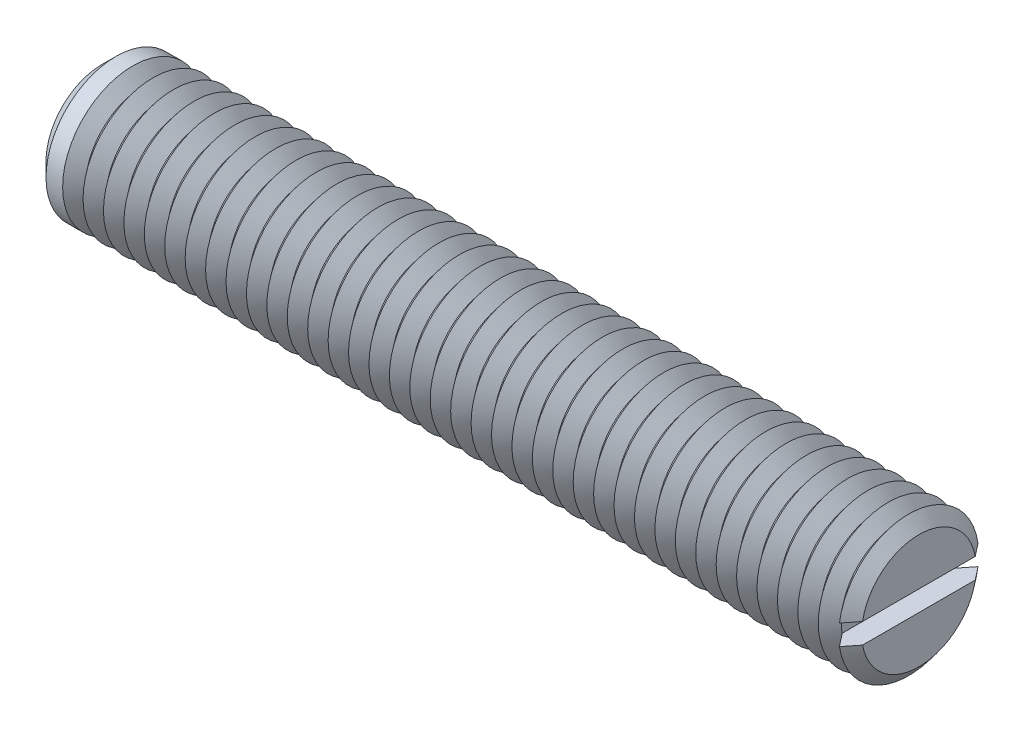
ISO-10303-21;
HEADER;
FILE_DESCRIPTION(('STEP AP214'),'2;1');
FILE_NAME('part.step','',(''),(''),'','','');
FILE_SCHEMA(('AUTOMOTIVE_DESIGN { 1 0 10303 214 1 1 1 1 }'));
ENDSEC;
DATA;
#1=APPLICATION_CONTEXT('core data for automotive mechanical design processes');
#2=APPLICATION_PROTOCOL_DEFINITION('international standard','automotive_design',2000,#1);
#3=PRODUCT_CONTEXT('',#1,'mechanical');
#4=PRODUCT('Part','Part','',(#3));
#5=PRODUCT_RELATED_PRODUCT_CATEGORY('part','',(#4));
#6=PRODUCT_DEFINITION_FORMATION('','',#4);
#7=PRODUCT_DEFINITION_CONTEXT('part definition',#1,'design');
#8=PRODUCT_DEFINITION('design','',#6,#7);
#9=PRODUCT_DEFINITION_SHAPE('','',#8);
#10=(LENGTH_UNIT() NAMED_UNIT(*) SI_UNIT(.MILLI.,.METRE.));
#11=(NAMED_UNIT(*) PLANE_ANGLE_UNIT() SI_UNIT($,.RADIAN.));
#12=(NAMED_UNIT(*) SI_UNIT($,.STERADIAN.) SOLID_ANGLE_UNIT());
#13=UNCERTAINTY_MEASURE_WITH_UNIT(LENGTH_MEASURE(1.E-05),#10,'distance_accuracy_value','');
#14=(GEOMETRIC_REPRESENTATION_CONTEXT(3) GLOBAL_UNCERTAINTY_ASSIGNED_CONTEXT((#13)) GLOBAL_UNIT_ASSIGNED_CONTEXT((#10,
#11,#12)) REPRESENTATION_CONTEXT('',''));
#15=CARTESIAN_POINT('',(0.,0.,0.));
#16=DIRECTION('',(0.,0.,1.));
#17=DIRECTION('',(1.,0.,0.));
#18=AXIS2_PLACEMENT_3D('',#15,#16,#17);
#19=CARTESIAN_POINT('',(34.125,0.,0.));
#20=DIRECTION('',(1.,0.,0.));
#21=DIRECTION('',(0.,0.,-1.));
#22=AXIS2_PLACEMENT_3D('',#19,#20,#21);
#23=CONICAL_SURFACE('',#22,6.,0.895664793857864);
#24=CARTESIAN_POINT('',(34.125,0.,0.));
#25=DIRECTION('',(-1.,0.,0.));
#26=DIRECTION('',(0.,0.,1.));
#27=AXIS2_PLACEMENT_3D('',#24,#25,#26);
#28=CIRCLE('',#27,6.);
#29=CARTESIAN_POINT('',(34.125,-0.875,-5.93585503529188));
#30=VERTEX_POINT('',#29);
#31=CARTESIAN_POINT('',(34.125,-0.874999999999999,5.93585503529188));
#32=VERTEX_POINT('',#31);
#33=EDGE_CURVE('E117',#30,#32,#28,.T.);
#34=ORIENTED_EDGE('',*,*,#33,.T.);
#35=CARTESIAN_POINT('',(39.815666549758,-0.875,-13.0784023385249));
#36=CARTESIAN_POINT('',(39.4425848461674,-0.875,-12.6113718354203));
#37=CARTESIAN_POINT('',(39.0695485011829,-0.875,-12.1443050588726));
#38=CARTESIAN_POINT('',(38.3235952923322,-0.875,-11.2100035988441));
#39=CARTESIAN_POINT('',(37.9506784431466,-0.875,-10.7427689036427));
#40=CARTESIAN_POINT('',(37.2043910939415,-0.875,-9.80728158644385));
#41=CARTESIAN_POINT('',(36.8310209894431,-0.875,-9.33902864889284));
#42=CARTESIAN_POINT('',(36.084654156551,-0.875,-8.40229688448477));
#43=CARTESIAN_POINT('',(35.7116573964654,-0.875,-7.93381808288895));
#44=CARTESIAN_POINT('',(35.1431910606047,-0.875,-7.21894008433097));
#45=CARTESIAN_POINT('',(34.9475150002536,-0.875,-6.97270509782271));
#46=CARTESIAN_POINT('',(34.5563780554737,-0.875,-6.48006014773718));
#47=CARTESIAN_POINT('',(34.3609171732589,-0.875,-6.23365018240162));
#48=CARTESIAN_POINT('',(33.9702437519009,-0.875,-5.74051596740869));
#49=CARTESIAN_POINT('',(33.7750313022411,-0.875,-5.4937916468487));
#50=CARTESIAN_POINT('',(33.3850627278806,-0.875,-4.99999724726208));
#51=CARTESIAN_POINT('',(33.1903065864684,-0.875,-4.75292718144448));
#52=CARTESIAN_POINT('',(32.8017454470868,-0.875,-4.2585469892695));
#53=CARTESIAN_POINT('',(32.6079395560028,-0.875,-4.01123756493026));
#54=CARTESIAN_POINT('',(32.2214614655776,-0.875,-3.51567639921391));
#55=CARTESIAN_POINT('',(32.0287894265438,-0.875,-3.26742453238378));
#56=CARTESIAN_POINT('',(31.7415141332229,-0.875,-2.89382702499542));
#57=CARTESIAN_POINT('',(31.6460716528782,-0.875,-2.76912721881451));
#58=CARTESIAN_POINT('',(31.4560120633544,-0.875,-2.51908954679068));
#59=CARTESIAN_POINT('',(31.3613949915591,-0.875,-2.39375165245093));
#60=CARTESIAN_POINT('',(31.1734585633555,-0.875,-2.14215479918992));
#61=CARTESIAN_POINT('',(31.0801388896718,-0.875,-2.01589607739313));
#62=CARTESIAN_POINT('',(30.8955738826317,-0.875,-1.76187409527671));
#63=CARTESIAN_POINT('',(30.8043283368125,-0.875,-1.63411099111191));
#64=CARTESIAN_POINT('',(30.6947335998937,-0.875,-1.47575777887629));
#65=CARTESIAN_POINT('',(30.6745750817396,-0.875,-1.44642115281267));
#66=CARTESIAN_POINT('',(30.6344943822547,-0.875,-1.38758643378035));
#67=CARTESIAN_POINT('',(30.6145722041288,-0.875,-1.35808833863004));
#68=CARTESIAN_POINT('',(30.5552118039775,-0.875,-1.26931303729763));
#69=CARTESIAN_POINT('',(30.5161833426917,-0.875,-1.20976002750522));
#70=CARTESIAN_POINT('',(30.439598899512,-0.875,-1.08955604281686));
#71=CARTESIAN_POINT('',(30.4020457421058,-0.875,-1.02890325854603));
#72=CARTESIAN_POINT('',(30.3292052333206,-0.875,-0.906252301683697));
#73=CARTESIAN_POINT('',(30.2939174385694,-0.875,-0.844254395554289));
#74=CARTESIAN_POINT('',(30.2387563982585,-0.875,-0.74080235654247));
#75=CARTESIAN_POINT('',(30.217869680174,-0.875,-0.699896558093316));
#76=CARTESIAN_POINT('',(30.1780353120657,-0.875,-0.617162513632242));
#77=CARTESIAN_POINT('',(30.1590880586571,-0.875,-0.575334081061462));
#78=CARTESIAN_POINT('',(30.106232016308,-0.875,-0.448426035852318));
#79=CARTESIAN_POINT('',(30.0761075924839,-0.875,-0.361569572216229));
#80=CARTESIAN_POINT('',(30.0472166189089,-0.875,-0.240214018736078));
#81=CARTESIAN_POINT('',(30.0406925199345,-0.875,-0.207555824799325));
#82=CARTESIAN_POINT('',(30.0303887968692,-0.875,-0.141816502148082));
#83=CARTESIAN_POINT('',(30.0266076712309,-0.875,-0.108735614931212));
#84=CARTESIAN_POINT('',(30.0220436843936,-0.875,-0.0424543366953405));
#85=CARTESIAN_POINT('',(30.0212526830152,-0.875,-0.00925451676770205));
#86=CARTESIAN_POINT('',(30.0227025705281,-0.875,0.0570804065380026));
#87=CARTESIAN_POINT('',(30.0249438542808,-0.875,0.0902155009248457));
#88=CARTESIAN_POINT('',(30.0331880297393,-0.875,0.164063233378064));
#89=CARTESIAN_POINT('',(30.0399634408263,-0.875,0.204689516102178));
#90=CARTESIAN_POINT('',(30.0573167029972,-0.875,0.285126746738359));
#91=CARTESIAN_POINT('',(30.0678973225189,-0.875,0.324937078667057));
#92=CARTESIAN_POINT('',(30.0921930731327,-0.875,0.403898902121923));
#93=CARTESIAN_POINT('',(30.1059311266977,-0.875,0.44304320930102));
#94=CARTESIAN_POINT('',(30.1357974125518,-0.875,0.520385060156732));
#95=CARTESIAN_POINT('',(30.151925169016,-0.875,0.558582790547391));
#96=CARTESIAN_POINT('',(30.2021457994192,-0.875,0.669991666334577));
#97=CARTESIAN_POINT('',(30.2387706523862,-0.875,0.742052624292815));
#98=CARTESIAN_POINT('',(30.316117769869,-0.875,0.883956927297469));
#99=CARTESIAN_POINT('',(30.3568440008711,-0.875,0.953798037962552));
#100=CARTESIAN_POINT('',(30.4409804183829,-0.875,1.09208391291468));
#101=CARTESIAN_POINT('',(30.4843973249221,-0.875,1.16052456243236));
#102=CARTESIAN_POINT('',(30.5729384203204,-0.875,1.29629435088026));
#103=CARTESIAN_POINT('',(30.618062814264,-0.875,1.36362335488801));
#104=CARTESIAN_POINT('',(30.7096565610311,-0.875,1.49772496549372));
#105=CARTESIAN_POINT('',(30.7561302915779,-0.875,1.56449457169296));
#106=CARTESIAN_POINT('',(30.8499281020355,-0.875,1.69744165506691));
#107=CARTESIAN_POINT('',(30.8972522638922,-0.875,1.76361907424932));
#108=CARTESIAN_POINT('',(30.9924358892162,-0.875,1.89539956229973));
#109=CARTESIAN_POINT('',(31.0402941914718,-0.875,1.96100347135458));
#110=CARTESIAN_POINT('',(31.1364816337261,-0.875,2.09186112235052));
#111=CARTESIAN_POINT('',(31.1848107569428,-0.875,2.15711487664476));
#112=CARTESIAN_POINT('',(31.3290907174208,-0.875,2.35079303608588));
#113=CARTESIAN_POINT('',(31.425565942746,-0.875,2.47882657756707));
#114=CARTESIAN_POINT('',(31.6194152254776,-0.875,2.73421191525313));
#115=CARTESIAN_POINT('',(31.716789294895,-0.875,2.86156370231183));
#116=CARTESIAN_POINT('',(32.00981832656,-0.875,3.24294102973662));
#117=CARTESIAN_POINT('',(32.2063709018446,-0.875,3.49627631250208));
#118=CARTESIAN_POINT('',(32.6008478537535,-0.875,4.00219025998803));
#119=CARTESIAN_POINT('',(32.7987731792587,-0.875,4.25476818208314));
#120=CARTESIAN_POINT('',(33.1953507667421,-0.875,4.75934213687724));
#121=CARTESIAN_POINT('',(33.394003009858,-0.875,5.01133818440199));
#122=CARTESIAN_POINT('',(33.7908446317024,-0.875,5.51379367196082));
#123=CARTESIAN_POINT('',(33.9890318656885,-0.875,5.76425480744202));
#124=CARTESIAN_POINT('',(34.3857195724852,-0.875,6.26493161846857));
#125=CARTESIAN_POINT('',(34.5842200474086,-0.875,6.51514729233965));
#126=CARTESIAN_POINT('',(35.1799499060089,-0.875,7.26541710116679));
#127=CARTESIAN_POINT('',(35.5775028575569,-0.875,7.76521426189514));
#128=CARTESIAN_POINT('',(36.2943115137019,-0.875,8.6655030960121));
#129=CARTESIAN_POINT('',(36.6134832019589,-0.875,9.06606170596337));
#130=CARTESIAN_POINT('',(37.2520581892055,-0.875,9.86704239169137));
#131=CARTESIAN_POINT('',(37.5714615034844,-0.875,10.2674644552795));
#132=CARTESIAN_POINT('',(38.2116162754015,-0.875,11.0697025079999));
#133=CARTESIAN_POINT('',(38.5323682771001,-0.875,11.4715180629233));
#134=CARTESIAN_POINT('',(39.1739570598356,-0.875,12.2750327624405));
#135=CARTESIAN_POINT('',(39.4947938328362,-0.875,12.6767319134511));
#136=CARTESIAN_POINT('',(39.815666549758,-0.875,13.0784023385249));
#137=B_SPLINE_CURVE_WITH_KNOTS('',3,(#35,#36,#37,#38,#39,#40,#41,#42,#43,#44,#45,#46,#47,#48,
#49,#50,#51,#52,#53,#54,#55,#56,#57,#58,#59,#60,#61,#62,#63,#64,#65,#66,#67,#68,#69,#70,#71,#72,
#73,#74,#75,#76,#77,#78,#79,#80,#81,#82,#83,#84,#85,#86,#87,#88,#89,#90,#91,#92,#93,#94,#95,#96,
#97,#98,#99,#100,#101,#102,#103,#104,#105,#106,#107,#108,#109,#110,#111,#112,#113,#114,#115,
#116,#117,#118,#119,#120,#121,#122,#123,#124,#125,#126,#127,#128,#129,#130,#131,#132,#133,#134,
#135,#136),.UNSPECIFIED.,.F.,.F.,(4,2,2,2,2,2,2,2,2,2,2,2,2,2,2,2,2,2,2,2,2,2,2,2,2,2,2,2,2,2,2,
2,2,2,2,2,2,2,2,2,2,2,2,2,2,2,2,2,2,2,4),(0.,1.79325603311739,3.58668207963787,5.38334403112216,
7.17983772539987,8.12338791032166,9.06694771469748,10.0107838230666,10.9545848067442,
11.8971886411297,12.8399226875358,13.3110192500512,13.7821370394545,14.2531375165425,
14.72408952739,14.8308734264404,14.9376587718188,15.1512485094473,15.3652290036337,
15.5791674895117,15.7169026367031,15.8546658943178,16.1289739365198,16.2287885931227,
16.3285485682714,16.4280367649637,16.5275379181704,16.6508760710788,16.7743041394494,
16.8986582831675,17.0229876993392,17.2652294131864,17.5077076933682,17.7508180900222,
17.9939577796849,18.2380016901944,18.4820692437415,18.7256822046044,18.9692865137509,
19.4502162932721,19.9311525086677,20.8930708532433,21.855738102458,22.8183805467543,
23.7765455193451,24.7347169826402,26.6505999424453,28.1871088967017,29.7237307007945,
31.2661438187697,32.8084427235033),.UNSPECIFIED.);
#138=CARTESIAN_POINT('',(33.25,-0.875,4.82848363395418));
#139=VERTEX_POINT('',#138);
#140=EDGE_CURVE('E109',#139,#32,#137,.T.);
#141=ORIENTED_EDGE('',*,*,#140,.F.);
#142=CARTESIAN_POINT('',(33.25,0.,0.));
#143=DIRECTION('',(-1.,0.,0.));
#144=DIRECTION('',(0.,0.,1.));
#145=AXIS2_PLACEMENT_3D('',#142,#143,#144);
#146=CIRCLE('',#145,4.90712535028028);
#147=CARTESIAN_POINT('',(33.25,-0.875,-4.82848363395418));
#148=VERTEX_POINT('',#147);
#149=EDGE_CURVE('E528',#148,#139,#146,.T.);
#150=ORIENTED_EDGE('',*,*,#149,.F.);
#151=EDGE_CURVE('E58',#30,#148,#137,.T.);
#152=ORIENTED_EDGE('',*,*,#151,.F.);
#153=EDGE_LOOP('',(#34,#141,#150,#152));
#154=FACE_BOUND('',#153,.T.);
#155=ADVANCED_FACE('F37',(#154),#23,.T.);
#156=CARTESIAN_POINT('',(34.125,0.874999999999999,5.93585503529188));
#157=VERTEX_POINT('',#156);
#158=CARTESIAN_POINT('',(34.125,0.874999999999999,-5.93585503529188));
#159=VERTEX_POINT('',#158);
#160=EDGE_CURVE('E100',#157,#159,#28,.T.);
#161=ORIENTED_EDGE('',*,*,#160,.T.);
#162=CARTESIAN_POINT('',(39.815666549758,0.875,13.0784023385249));
#163=CARTESIAN_POINT('',(39.4425848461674,0.875,12.6113718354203));
#164=CARTESIAN_POINT('',(39.0695485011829,0.875,12.1443050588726));
#165=CARTESIAN_POINT('',(38.3235952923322,0.875,11.2100035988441));
#166=CARTESIAN_POINT('',(37.9506784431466,0.875,10.7427689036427));
#167=CARTESIAN_POINT('',(37.2043910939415,0.875,9.80728158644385));
#168=CARTESIAN_POINT('',(36.8310209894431,0.875,9.33902864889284));
#169=CARTESIAN_POINT('',(36.084654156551,0.875,8.40229688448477));
#170=CARTESIAN_POINT('',(35.7116573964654,0.875,7.93381808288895));
#171=CARTESIAN_POINT('',(35.1431910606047,0.875,7.21894008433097));
#172=CARTESIAN_POINT('',(34.9475150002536,0.875,6.97270509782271));
#173=CARTESIAN_POINT('',(34.5563780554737,0.875,6.48006014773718));
#174=CARTESIAN_POINT('',(34.3609171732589,0.875,6.23365018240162));
#175=CARTESIAN_POINT('',(33.9702437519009,0.875,5.74051596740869));
#176=CARTESIAN_POINT('',(33.7750313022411,0.875,5.4937916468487));
#177=CARTESIAN_POINT('',(33.3850627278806,0.875,4.99999724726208));
#178=CARTESIAN_POINT('',(33.1903065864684,0.875,4.75292718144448));
#179=CARTESIAN_POINT('',(32.8017454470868,0.875,4.2585469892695));
#180=CARTESIAN_POINT('',(32.6079395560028,0.875,4.01123756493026));
#181=CARTESIAN_POINT('',(32.2214614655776,0.875,3.51567639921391));
#182=CARTESIAN_POINT('',(32.0287894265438,0.875,3.26742453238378));
#183=CARTESIAN_POINT('',(31.7415141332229,0.875,2.89382702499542));
#184=CARTESIAN_POINT('',(31.6460716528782,0.875,2.76912721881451));
#185=CARTESIAN_POINT('',(31.4560120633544,0.875,2.51908954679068));
#186=CARTESIAN_POINT('',(31.3613949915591,0.875,2.39375165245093));
#187=CARTESIAN_POINT('',(31.1734585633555,0.875,2.14215479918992));
#188=CARTESIAN_POINT('',(31.0801388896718,0.875,2.01589607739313));
#189=CARTESIAN_POINT('',(30.8955738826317,0.875,1.76187409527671));
#190=CARTESIAN_POINT('',(30.8043283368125,0.875,1.63411099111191));
#191=CARTESIAN_POINT('',(30.6947335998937,0.875,1.47575777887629));
#192=CARTESIAN_POINT('',(30.6745750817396,0.875,1.44642115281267));
#193=CARTESIAN_POINT('',(30.6344943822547,0.875,1.38758643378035));
#194=CARTESIAN_POINT('',(30.6145722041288,0.875,1.35808833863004));
#195=CARTESIAN_POINT('',(30.5552118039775,0.875,1.26931303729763));
#196=CARTESIAN_POINT('',(30.5161833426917,0.875,1.20976002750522));
#197=CARTESIAN_POINT('',(30.439598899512,0.875,1.08955604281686));
#198=CARTESIAN_POINT('',(30.4020457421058,0.875,1.02890325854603));
#199=CARTESIAN_POINT('',(30.3292052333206,0.875,0.906252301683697));
#200=CARTESIAN_POINT('',(30.2939174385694,0.875,0.844254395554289));
#201=CARTESIAN_POINT('',(30.2387563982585,0.875,0.74080235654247));
#202=CARTESIAN_POINT('',(30.217869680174,0.875,0.699896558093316));
#203=CARTESIAN_POINT('',(30.1780353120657,0.875,0.617162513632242));
#204=CARTESIAN_POINT('',(30.1590880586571,0.875,0.575334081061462));
#205=CARTESIAN_POINT('',(30.106232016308,0.875,0.448426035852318));
#206=CARTESIAN_POINT('',(30.0761075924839,0.875,0.361569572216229));
#207=CARTESIAN_POINT('',(30.0472166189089,0.875,0.240214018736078));
#208=CARTESIAN_POINT('',(30.0406925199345,0.875,0.207555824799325));
#209=CARTESIAN_POINT('',(30.0303887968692,0.875,0.141816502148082));
#210=CARTESIAN_POINT('',(30.0266076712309,0.875,0.108735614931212));
#211=CARTESIAN_POINT('',(30.0220436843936,0.875,0.0424543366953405));
#212=CARTESIAN_POINT('',(30.0212526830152,0.875,0.00925451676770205));
#213=CARTESIAN_POINT('',(30.0227025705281,0.875,-0.0570804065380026));
#214=CARTESIAN_POINT('',(30.0249438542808,0.875,-0.0902155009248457));
#215=CARTESIAN_POINT('',(30.0331880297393,0.875,-0.164063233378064));
#216=CARTESIAN_POINT('',(30.0399634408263,0.875,-0.204689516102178));
#217=CARTESIAN_POINT('',(30.0573167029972,0.875,-0.285126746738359));
#218=CARTESIAN_POINT('',(30.0678973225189,0.875,-0.324937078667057));
#219=CARTESIAN_POINT('',(30.0921930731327,0.875,-0.403898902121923));
#220=CARTESIAN_POINT('',(30.1059311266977,0.875,-0.44304320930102));
#221=CARTESIAN_POINT('',(30.1357974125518,0.875,-0.520385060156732));
#222=CARTESIAN_POINT('',(30.151925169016,0.875,-0.558582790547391));
#223=CARTESIAN_POINT('',(30.2021457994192,0.875,-0.669991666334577));
#224=CARTESIAN_POINT('',(30.2387706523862,0.875,-0.742052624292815));
#225=CARTESIAN_POINT('',(30.316117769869,0.875,-0.883956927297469));
#226=CARTESIAN_POINT('',(30.3568440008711,0.875,-0.953798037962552));
#227=CARTESIAN_POINT('',(30.4409804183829,0.875,-1.09208391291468));
#228=CARTESIAN_POINT('',(30.4843973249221,0.875,-1.16052456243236));
#229=CARTESIAN_POINT('',(30.5729384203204,0.875,-1.29629435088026));
#230=CARTESIAN_POINT('',(30.618062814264,0.875,-1.36362335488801));
#231=CARTESIAN_POINT('',(30.7096565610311,0.875,-1.49772496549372));
#232=CARTESIAN_POINT('',(30.7561302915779,0.875,-1.56449457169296));
#233=CARTESIAN_POINT('',(30.8499281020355,0.875,-1.69744165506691));
#234=CARTESIAN_POINT('',(30.8972522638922,0.875,-1.76361907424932));
#235=CARTESIAN_POINT('',(30.9924358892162,0.875,-1.89539956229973));
#236=CARTESIAN_POINT('',(31.0402941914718,0.875,-1.96100347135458));
#237=CARTESIAN_POINT('',(31.1364816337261,0.875,-2.09186112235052));
#238=CARTESIAN_POINT('',(31.1848107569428,0.875,-2.15711487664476));
#239=CARTESIAN_POINT('',(31.3290907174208,0.875,-2.35079303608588));
#240=CARTESIAN_POINT('',(31.425565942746,0.875,-2.47882657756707));
#241=CARTESIAN_POINT('',(31.6194152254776,0.875,-2.73421191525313));
#242=CARTESIAN_POINT('',(31.716789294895,0.875,-2.86156370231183));
#243=CARTESIAN_POINT('',(32.00981832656,0.875,-3.24294102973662));
#244=CARTESIAN_POINT('',(32.2063709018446,0.875,-3.49627631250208));
#245=CARTESIAN_POINT('',(32.6008478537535,0.875,-4.00219025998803));
#246=CARTESIAN_POINT('',(32.7987731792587,0.875,-4.25476818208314));
#247=CARTESIAN_POINT('',(33.1953507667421,0.875,-4.75934213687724));
#248=CARTESIAN_POINT('',(33.394003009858,0.875,-5.01133818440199));
#249=CARTESIAN_POINT('',(33.7908446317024,0.875,-5.51379367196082));
#250=CARTESIAN_POINT('',(33.9890318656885,0.875,-5.76425480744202));
#251=CARTESIAN_POINT('',(34.3857195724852,0.875,-6.26493161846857));
#252=CARTESIAN_POINT('',(34.5842200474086,0.875,-6.51514729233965));
#253=CARTESIAN_POINT('',(35.1799499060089,0.875,-7.26541710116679));
#254=CARTESIAN_POINT('',(35.5775028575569,0.875,-7.76521426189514));
#255=CARTESIAN_POINT('',(36.2943115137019,0.875,-8.6655030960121));
#256=CARTESIAN_POINT('',(36.6134832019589,0.875,-9.06606170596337));
#257=CARTESIAN_POINT('',(37.2520581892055,0.875,-9.86704239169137));
#258=CARTESIAN_POINT('',(37.5714615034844,0.875,-10.2674644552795));
#259=CARTESIAN_POINT('',(38.2116162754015,0.875,-11.0697025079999));
#260=CARTESIAN_POINT('',(38.5323682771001,0.875,-11.4715180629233));
#261=CARTESIAN_POINT('',(39.1739570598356,0.875,-12.2750327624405));
#262=CARTESIAN_POINT('',(39.4947938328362,0.875,-12.6767319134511));
#263=CARTESIAN_POINT('',(39.815666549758,0.875,-13.0784023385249));
#264=B_SPLINE_CURVE_WITH_KNOTS('',3,(#162,#163,#164,#165,#166,#167,#168,#169,#170,#171,#172,
#173,#174,#175,#176,#177,#178,#179,#180,#181,#182,#183,#184,#185,#186,#187,#188,#189,#190,#191,
#192,#193,#194,#195,#196,#197,#198,#199,#200,#201,#202,#203,#204,#205,#206,#207,#208,#209,#210,
#211,#212,#213,#214,#215,#216,#217,#218,#219,#220,#221,#222,#223,#224,#225,#226,#227,#228,#229,
#230,#231,#232,#233,#234,#235,#236,#237,#238,#239,#240,#241,#242,#243,#244,#245,#246,#247,#248,
#249,#250,#251,#252,#253,#254,#255,#256,#257,#258,#259,#260,#261,#262,#263),.UNSPECIFIED.,.F.,
.F.,(4,2,2,2,2,2,2,2,2,2,2,2,2,2,2,2,2,2,2,2,2,2,2,2,2,2,2,2,2,2,2,2,2,2,2,2,2,2,2,2,2,2,2,2,2,
2,2,2,2,2,4),(0.,1.79325603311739,3.58668207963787,5.38334403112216,7.17983772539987,
8.12338791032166,9.06694771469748,10.0107838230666,10.9545848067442,11.8971886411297,
12.8399226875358,13.3110192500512,13.7821370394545,14.2531375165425,14.72408952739,
14.8308734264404,14.9376587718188,15.1512485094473,15.3652290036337,15.5791674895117,
15.7169026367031,15.8546658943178,16.1289739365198,16.2287885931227,16.3285485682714,
16.4280367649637,16.5275379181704,16.6508760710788,16.7743041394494,16.8986582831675,
17.0229876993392,17.2652294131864,17.5077076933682,17.7508180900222,17.9939577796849,
18.2380016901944,18.4820692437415,18.7256822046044,18.9692865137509,19.4502162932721,
19.9311525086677,20.8930708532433,21.855738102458,22.8183805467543,23.7765455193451,
24.7347169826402,26.6505999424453,28.1871088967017,29.7237307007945,31.2661438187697,
32.8084427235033),.UNSPECIFIED.);
#265=CARTESIAN_POINT('',(33.25,0.875,-4.82848363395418));
#266=VERTEX_POINT('',#265);
#267=EDGE_CURVE('E110',#266,#159,#264,.T.);
#268=ORIENTED_EDGE('',*,*,#267,.F.);
#269=CARTESIAN_POINT('',(33.25,0.875,4.82848363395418));
#270=VERTEX_POINT('',#269);
#271=EDGE_CURVE('E103',#270,#266,#146,.T.);
#272=ORIENTED_EDGE('',*,*,#271,.F.);
#273=EDGE_CURVE('E97',#157,#270,#264,.T.);
#274=ORIENTED_EDGE('',*,*,#273,.F.);
#275=EDGE_LOOP('',(#161,#268,#272,#274));
#276=FACE_BOUND('',#275,.T.);
#277=ADVANCED_FACE('F99',(#276),#23,.T.);
#278=CARTESIAN_POINT('',(33.25,0.,0.));
#279=DIRECTION('',(-1.,0.,0.));
#280=DIRECTION('',(0.,0.,1.));
#281=AXIS2_PLACEMENT_3D('',#278,#279,#280);
#282=CONICAL_SURFACE('',#281,4.90712535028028,0.895664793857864);
#283=CARTESIAN_POINT('',(32.375,0.,0.));
#284=DIRECTION('',(-1.,0.,0.));
#285=DIRECTION('',(0.,0.,1.));
#286=AXIS2_PLACEMENT_3D('',#283,#284,#285);
#287=CIRCLE('',#286,6.);
#288=CARTESIAN_POINT('',(32.375,0.,6.));
#289=VERTEX_POINT('',#288);
#290=EDGE_CURVE('E513',#289,#289,#287,.T.);
#291=ORIENTED_EDGE('',*,*,#290,.F.);
#292=EDGE_LOOP('',(#291));
#293=FACE_BOUND('',#292,.T.);
#294=ORIENTED_EDGE('',*,*,#271,.T.);
#295=EDGE_CURVE('E522',#266,#148,#146,.T.);
#296=ORIENTED_EDGE('',*,*,#295,.T.);
#297=ORIENTED_EDGE('',*,*,#149,.T.);
#298=EDGE_CURVE('E520',#139,#270,#146,.T.);
#299=ORIENTED_EDGE('',*,*,#298,.T.);
#300=EDGE_LOOP('',(#294,#296,#297,#299));
#301=FACE_BOUND('',#300,.T.);
#302=ADVANCED_FACE('F167',(#293,#301),#282,.T.);
#303=CARTESIAN_POINT('',(35.,0.,0.));
#304=DIRECTION('',(1.,0.,0.));
#305=DIRECTION('',(0.,0.,-1.));
#306=AXIS2_PLACEMENT_3D('',#303,#304,#305);
#307=PLANE('',#306);
#308=CARTESIAN_POINT('',(35.,0.,0.));
#309=DIRECTION('',(-1.,0.,0.));
#310=DIRECTION('',(0.,0.,1.));
#311=AXIS2_PLACEMENT_3D('',#308,#309,#310);
#312=CIRCLE('',#311,4.90712535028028);
#313=CARTESIAN_POINT('',(35.,0.875,4.82848363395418));
#314=VERTEX_POINT('',#313);
#315=CARTESIAN_POINT('',(35.,0.875,-4.82848363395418));
#316=VERTEX_POINT('',#315);
#317=EDGE_CURVE('E159',#314,#316,#312,.T.);
#318=ORIENTED_EDGE('',*,*,#317,.F.);
#319=DIRECTION('',(0.,0.,1.));
#320=VECTOR('',#319,1.);
#321=CARTESIAN_POINT('',(35.,0.875,0.));
#322=LINE('',#321,#320);
#323=EDGE_CURVE('E122',#316,#314,#322,.T.);
#324=ORIENTED_EDGE('',*,*,#323,.F.);
#325=EDGE_LOOP('',(#318,#324));
#326=FACE_BOUND('',#325,.T.);
#327=ADVANCED_FACE('F171',(#326),#307,.T.);
#328=CARTESIAN_POINT('',(35.,-0.875,-4.82848363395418));
#329=VERTEX_POINT('',#328);
#330=CARTESIAN_POINT('',(35.,-0.875,4.82848363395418));
#331=VERTEX_POINT('',#330);
#332=EDGE_CURVE('E66',#329,#331,#312,.T.);
#333=ORIENTED_EDGE('',*,*,#332,.F.);
#334=DIRECTION('',(0.,0.,-1.));
#335=VECTOR('',#334,1.);
#336=CARTESIAN_POINT('',(35.,-0.875,0.));
#337=LINE('',#336,#335);
#338=EDGE_CURVE('E136',#331,#329,#337,.T.);
#339=ORIENTED_EDGE('',*,*,#338,.F.);
#340=EDGE_LOOP('',(#333,#339));
#341=FACE_BOUND('',#340,.T.);
#342=ADVANCED_FACE('F200',(#341),#307,.T.);
#343=CARTESIAN_POINT('',(35.,0.,0.));
#344=DIRECTION('',(-1.,0.,0.));
#345=DIRECTION('',(0.,0.,1.));
#346=AXIS2_PLACEMENT_3D('',#343,#344,#345);
#347=CONICAL_SURFACE('',#346,4.90712535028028,0.895664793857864);
#348=ORIENTED_EDGE('',*,*,#160,.F.);
#349=CARTESIAN_POINT('',(28.434333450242,0.875,-13.0784023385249));
#350=CARTESIAN_POINT('',(28.8074151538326,0.875,-12.6113718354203));
#351=CARTESIAN_POINT('',(29.1804514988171,0.875,-12.1443050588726));
#352=CARTESIAN_POINT('',(29.9264047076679,0.875,-11.2100035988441));
#353=CARTESIAN_POINT('',(30.2993215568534,0.875,-10.7427689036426));
#354=CARTESIAN_POINT('',(31.0456089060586,0.875,-9.80728158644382));
#355=CARTESIAN_POINT('',(31.418979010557,0.875,-9.3390286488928));
#356=CARTESIAN_POINT('',(32.165345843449,0.875,-8.40229688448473));
#357=CARTESIAN_POINT('',(32.5383426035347,0.875,-7.93381808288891));
#358=CARTESIAN_POINT('',(33.1068089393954,0.875,-7.21894008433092));
#359=CARTESIAN_POINT('',(33.3024849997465,0.875,-6.97270509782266));
#360=CARTESIAN_POINT('',(33.6936219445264,0.875,-6.48006014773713));
#361=CARTESIAN_POINT('',(33.8890828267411,0.875,-6.23365018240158));
#362=CARTESIAN_POINT('',(34.2797562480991,0.875,-5.74051596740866));
#363=CARTESIAN_POINT('',(34.474968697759,0.875,-5.49379164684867));
#364=CARTESIAN_POINT('',(34.8649372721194,0.875,-4.99999724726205));
#365=CARTESIAN_POINT('',(35.0596934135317,0.875,-4.75292718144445));
#366=CARTESIAN_POINT('',(35.4482545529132,0.875,-4.25854698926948));
#367=CARTESIAN_POINT('',(35.6420604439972,0.875,-4.01123756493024));
#368=CARTESIAN_POINT('',(36.0285385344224,0.875,-3.5156763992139));
#369=CARTESIAN_POINT('',(36.2212105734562,0.875,-3.26742453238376));
#370=CARTESIAN_POINT('',(36.5084858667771,0.875,-2.89382702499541));
#371=CARTESIAN_POINT('',(36.6039283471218,0.875,-2.76912721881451));
#372=CARTESIAN_POINT('',(36.7939879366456,0.875,-2.51908954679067));
#373=CARTESIAN_POINT('',(36.8886050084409,0.875,-2.39375165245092));
#374=CARTESIAN_POINT('',(37.0765414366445,0.875,-2.14215479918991));
#375=CARTESIAN_POINT('',(37.1698611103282,0.875,-2.01589607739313));
#376=CARTESIAN_POINT('',(37.3544261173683,0.875,-1.7618740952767));
#377=CARTESIAN_POINT('',(37.4456716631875,0.875,-1.63411099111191));
#378=CARTESIAN_POINT('',(37.5552664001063,0.875,-1.47575777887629));
#379=CARTESIAN_POINT('',(37.5754249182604,0.875,-1.44642115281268));
#380=CARTESIAN_POINT('',(37.6155056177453,0.875,-1.38758643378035));
#381=CARTESIAN_POINT('',(37.6354277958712,0.875,-1.35808833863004));
#382=CARTESIAN_POINT('',(37.6947881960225,0.875,-1.26931303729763));
#383=CARTESIAN_POINT('',(37.7338166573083,0.875,-1.20976002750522));
#384=CARTESIAN_POINT('',(37.810401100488,0.875,-1.08955604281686));
#385=CARTESIAN_POINT('',(37.8479542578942,0.875,-1.02890325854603));
#386=CARTESIAN_POINT('',(37.9207947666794,0.875,-0.906252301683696));
#387=CARTESIAN_POINT('',(37.9560825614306,0.875,-0.844254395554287));
#388=CARTESIAN_POINT('',(38.0112436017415,0.875,-0.740802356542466));
#389=CARTESIAN_POINT('',(38.032130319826,0.875,-0.699896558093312));
#390=CARTESIAN_POINT('',(38.0719646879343,0.875,-0.617162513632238));
#391=CARTESIAN_POINT('',(38.0909119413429,0.875,-0.575334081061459));
#392=CARTESIAN_POINT('',(38.143767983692,0.875,-0.448426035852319));
#393=CARTESIAN_POINT('',(38.1738924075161,0.875,-0.361569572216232));
#394=CARTESIAN_POINT('',(38.2027833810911,0.875,-0.240214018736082));
#395=CARTESIAN_POINT('',(38.2093074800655,0.875,-0.207555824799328));
#396=CARTESIAN_POINT('',(38.2196112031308,0.875,-0.141816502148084));
#397=CARTESIAN_POINT('',(38.2233923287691,0.875,-0.108735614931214));
#398=CARTESIAN_POINT('',(38.2279563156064,0.875,-0.0424543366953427));
#399=CARTESIAN_POINT('',(38.2287473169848,0.875,-0.00925451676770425));
#400=CARTESIAN_POINT('',(38.227297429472,0.875,0.0570804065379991));
#401=CARTESIAN_POINT('',(38.2250561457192,0.875,0.0902155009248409));
#402=CARTESIAN_POINT('',(38.2168119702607,0.875,0.164063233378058));
#403=CARTESIAN_POINT('',(38.2100365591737,0.875,0.204689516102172));
#404=CARTESIAN_POINT('',(38.1926832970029,0.875,0.285126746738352));
#405=CARTESIAN_POINT('',(38.1821026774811,0.875,0.32493707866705));
#406=CARTESIAN_POINT('',(38.1578069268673,0.875,0.403898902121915));
#407=CARTESIAN_POINT('',(38.1440688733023,0.875,0.443043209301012));
#408=CARTESIAN_POINT('',(38.1142025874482,0.875,0.520385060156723));
#409=CARTESIAN_POINT('',(38.098074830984,0.875,0.558582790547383));
#410=CARTESIAN_POINT('',(38.0478542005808,0.875,0.669991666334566));
#411=CARTESIAN_POINT('',(38.0112293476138,0.875,0.742052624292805));
#412=CARTESIAN_POINT('',(37.933882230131,0.875,0.883956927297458));
#413=CARTESIAN_POINT('',(37.8931559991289,0.875,0.953798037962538));
#414=CARTESIAN_POINT('',(37.8090195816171,0.875,1.09208391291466));
#415=CARTESIAN_POINT('',(37.7656026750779,0.875,1.16052456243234));
#416=CARTESIAN_POINT('',(37.6770615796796,0.875,1.29629435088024));
#417=CARTESIAN_POINT('',(37.631937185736,0.875,1.36362335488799));
#418=CARTESIAN_POINT('',(37.5403434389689,0.875,1.49772496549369));
#419=CARTESIAN_POINT('',(37.4938697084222,0.875,1.56449457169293));
#420=CARTESIAN_POINT('',(37.4000718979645,0.875,1.69744165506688));
#421=CARTESIAN_POINT('',(37.3527477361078,0.875,1.76361907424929));
#422=CARTESIAN_POINT('',(37.2575641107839,0.875,1.89539956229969));
#423=CARTESIAN_POINT('',(37.2097058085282,0.875,1.96100347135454));
#424=CARTESIAN_POINT('',(37.113518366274,0.875,2.09186112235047));
#425=CARTESIAN_POINT('',(37.0651892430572,0.875,2.15711487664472));
#426=CARTESIAN_POINT('',(36.9209092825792,0.875,2.35079303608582));
#427=CARTESIAN_POINT('',(36.824434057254,0.875,2.47882657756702));
#428=CARTESIAN_POINT('',(36.6305847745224,0.875,2.73421191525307));
#429=CARTESIAN_POINT('',(36.533210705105,0.875,2.86156370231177));
#430=CARTESIAN_POINT('',(36.2401816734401,0.875,3.24294102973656));
#431=CARTESIAN_POINT('',(36.0436290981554,0.875,3.496276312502));
#432=CARTESIAN_POINT('',(35.6491521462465,0.875,4.00219025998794));
#433=CARTESIAN_POINT('',(35.4512268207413,0.875,4.25476818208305));
#434=CARTESIAN_POINT('',(35.054649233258,0.875,4.75934213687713));
#435=CARTESIAN_POINT('',(34.8559969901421,0.875,5.01133818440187));
#436=CARTESIAN_POINT('',(34.4591553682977,0.875,5.51379367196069));
#437=CARTESIAN_POINT('',(34.2609681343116,0.875,5.76425480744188));
#438=CARTESIAN_POINT('',(33.864280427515,0.875,6.26493161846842));
#439=CARTESIAN_POINT('',(33.6657799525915,0.875,6.5151472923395));
#440=CARTESIAN_POINT('',(33.0700500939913,0.875,7.26541710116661));
#441=CARTESIAN_POINT('',(32.6724971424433,0.875,7.76521426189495));
#442=CARTESIAN_POINT('',(31.9556884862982,0.875,8.66550309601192));
#443=CARTESIAN_POINT('',(31.6365167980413,0.875,9.0660617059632));
#444=CARTESIAN_POINT('',(30.9979418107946,0.875,9.86704239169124));
#445=CARTESIAN_POINT('',(30.6785384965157,0.875,10.2674644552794));
#446=CARTESIAN_POINT('',(30.0383837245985,0.875,11.0697025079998));
#447=CARTESIAN_POINT('',(29.7176317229,0.875,11.4715180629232));
#448=CARTESIAN_POINT('',(29.0760429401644,0.875,12.2750327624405));
#449=CARTESIAN_POINT('',(28.7552061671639,0.875,12.6767319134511));
#450=CARTESIAN_POINT('',(28.434333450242,0.875,13.0784023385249));
#451=B_SPLINE_CURVE_WITH_KNOTS('',3,(#349,#350,#351,#352,#353,#354,#355,#356,#357,#358,#359,
#360,#361,#362,#363,#364,#365,#366,#367,#368,#369,#370,#371,#372,#373,#374,#375,#376,#377,#378,
#379,#380,#381,#382,#383,#384,#385,#386,#387,#388,#389,#390,#391,#392,#393,#394,#395,#396,#397,
#398,#399,#400,#401,#402,#403,#404,#405,#406,#407,#408,#409,#410,#411,#412,#413,#414,#415,#416,
#417,#418,#419,#420,#421,#422,#423,#424,#425,#426,#427,#428,#429,#430,#431,#432,#433,#434,#435,
#436,#437,#438,#439,#440,#441,#442,#443,#444,#445,#446,#447,#448,#449,#450),.UNSPECIFIED.,.F.,
.F.,(4,2,2,2,2,2,2,2,2,2,2,2,2,2,2,2,2,2,2,2,2,2,2,2,2,2,2,2,2,2,2,2,2,2,2,2,2,2,2,2,2,2,2,2,2,
2,2,2,2,2,4),(0.,1.79325603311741,3.58668207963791,5.38334403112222,7.17983772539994,
8.12338791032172,9.06694771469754,10.0107838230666,10.9545848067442,11.8971886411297,
12.8399226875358,13.3110192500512,13.7821370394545,14.2531375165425,14.72408952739,
14.8308734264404,14.9376587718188,15.1512485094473,15.3652290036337,15.5791674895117,
15.7169026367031,15.8546658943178,16.1289739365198,16.2287885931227,16.3285485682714,
16.4280367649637,16.5275379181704,16.6508760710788,16.7743041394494,16.8986582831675,
17.0229876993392,17.2652294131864,17.5077076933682,17.7508180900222,17.9939577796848,
18.2380016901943,18.4820692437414,18.7256822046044,18.9692865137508,19.450216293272,
19.9311525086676,20.8930708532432,21.8557381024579,22.8183805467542,23.7765455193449,
24.73471698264,26.6505999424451,28.1871088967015,29.7237307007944,31.2661438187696,
32.8084427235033),.UNSPECIFIED.);
#452=EDGE_CURVE('E41',#314,#157,#451,.T.);
#453=ORIENTED_EDGE('',*,*,#452,.F.);
#454=ORIENTED_EDGE('',*,*,#317,.T.);
#455=EDGE_CURVE('E11',#159,#316,#451,.T.);
#456=ORIENTED_EDGE('',*,*,#455,.F.);
#457=EDGE_LOOP('',(#348,#453,#454,#456));
#458=FACE_BOUND('',#457,.T.);
#459=ADVANCED_FACE('F114',(#458),#347,.T.);
#460=CARTESIAN_POINT('',(35.,0.875,-9.));
#461=DIRECTION('',(0.,1.,0.));
#462=DIRECTION('',(0.,0.,1.));
#463=AXIS2_PLACEMENT_3D('',#460,#461,#462);
#464=PLANE('',#463);
#465=ORIENTED_EDGE('',*,*,#452,.T.);
#466=ORIENTED_EDGE('',*,*,#273,.T.);
#467=DIRECTION('',(0.,0.,1.));
#468=VECTOR('',#467,1.);
#469=CARTESIAN_POINT('',(33.25,0.875,-9.));
#470=LINE('',#469,#468);
#471=EDGE_CURVE('E144',#266,#270,#470,.T.);
#472=ORIENTED_EDGE('',*,*,#471,.F.);
#473=ORIENTED_EDGE('',*,*,#267,.T.);
#474=ORIENTED_EDGE('',*,*,#455,.T.);
#475=ORIENTED_EDGE('',*,*,#323,.T.);
#476=EDGE_LOOP('',(#465,#466,#472,#473,#474,#475));
#477=FACE_BOUND('',#476,.T.);
#478=ADVANCED_FACE('F120',(#477),#464,.F.);
#479=ORIENTED_EDGE('',*,*,#33,.F.);
#480=CARTESIAN_POINT('',(28.434333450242,-0.875,13.0784023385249));
#481=CARTESIAN_POINT('',(28.8074151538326,-0.875,12.6113718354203));
#482=CARTESIAN_POINT('',(29.1804514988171,-0.875,12.1443050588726));
#483=CARTESIAN_POINT('',(29.9264047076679,-0.875,11.2100035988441));
#484=CARTESIAN_POINT('',(30.2993215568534,-0.875,10.7427689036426));
#485=CARTESIAN_POINT('',(31.0456089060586,-0.875,9.80728158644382));
#486=CARTESIAN_POINT('',(31.418979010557,-0.875,9.3390286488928));
#487=CARTESIAN_POINT('',(32.165345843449,-0.875,8.40229688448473));
#488=CARTESIAN_POINT('',(32.5383426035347,-0.875,7.93381808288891));
#489=CARTESIAN_POINT('',(33.1068089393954,-0.875,7.21894008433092));
#490=CARTESIAN_POINT('',(33.3024849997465,-0.875,6.97270509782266));
#491=CARTESIAN_POINT('',(33.6936219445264,-0.875,6.48006014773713));
#492=CARTESIAN_POINT('',(33.8890828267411,-0.875,6.23365018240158));
#493=CARTESIAN_POINT('',(34.2797562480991,-0.875,5.74051596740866));
#494=CARTESIAN_POINT('',(34.474968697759,-0.875,5.49379164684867));
#495=CARTESIAN_POINT('',(34.8649372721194,-0.875,4.99999724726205));
#496=CARTESIAN_POINT('',(35.0596934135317,-0.875,4.75292718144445));
#497=CARTESIAN_POINT('',(35.4482545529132,-0.875,4.25854698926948));
#498=CARTESIAN_POINT('',(35.6420604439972,-0.875,4.01123756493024));
#499=CARTESIAN_POINT('',(36.0285385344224,-0.875,3.5156763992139));
#500=CARTESIAN_POINT('',(36.2212105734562,-0.875,3.26742453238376));
#501=CARTESIAN_POINT('',(36.5084858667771,-0.875,2.89382702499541));
#502=CARTESIAN_POINT('',(36.6039283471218,-0.875,2.76912721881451));
#503=CARTESIAN_POINT('',(36.7939879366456,-0.875,2.51908954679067));
#504=CARTESIAN_POINT('',(36.8886050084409,-0.875,2.39375165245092));
#505=CARTESIAN_POINT('',(37.0765414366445,-0.875,2.14215479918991));
#506=CARTESIAN_POINT('',(37.1698611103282,-0.875,2.01589607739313));
#507=CARTESIAN_POINT('',(37.3544261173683,-0.875,1.7618740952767));
#508=CARTESIAN_POINT('',(37.4456716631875,-0.875,1.63411099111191));
#509=CARTESIAN_POINT('',(37.5552664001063,-0.875,1.47575777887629));
#510=CARTESIAN_POINT('',(37.5754249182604,-0.875,1.44642115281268));
#511=CARTESIAN_POINT('',(37.6155056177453,-0.875,1.38758643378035));
#512=CARTESIAN_POINT('',(37.6354277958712,-0.875,1.35808833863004));
#513=CARTESIAN_POINT('',(37.6947881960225,-0.875,1.26931303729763));
#514=CARTESIAN_POINT('',(37.7338166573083,-0.875,1.20976002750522));
#515=CARTESIAN_POINT('',(37.810401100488,-0.875,1.08955604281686));
#516=CARTESIAN_POINT('',(37.8479542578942,-0.875,1.02890325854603));
#517=CARTESIAN_POINT('',(37.9207947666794,-0.875,0.906252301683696));
#518=CARTESIAN_POINT('',(37.9560825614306,-0.875,0.844254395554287));
#519=CARTESIAN_POINT('',(38.0112436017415,-0.875,0.740802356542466));
#520=CARTESIAN_POINT('',(38.032130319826,-0.875,0.699896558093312));
#521=CARTESIAN_POINT('',(38.0719646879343,-0.875,0.617162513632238));
#522=CARTESIAN_POINT('',(38.0909119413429,-0.875,0.575334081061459));
#523=CARTESIAN_POINT('',(38.143767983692,-0.875,0.448426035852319));
#524=CARTESIAN_POINT('',(38.1738924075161,-0.875,0.361569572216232));
#525=CARTESIAN_POINT('',(38.2027833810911,-0.875,0.240214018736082));
#526=CARTESIAN_POINT('',(38.2093074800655,-0.875,0.207555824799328));
#527=CARTESIAN_POINT('',(38.2196112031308,-0.875,0.141816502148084));
#528=CARTESIAN_POINT('',(38.2233923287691,-0.875,0.108735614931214));
#529=CARTESIAN_POINT('',(38.2279563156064,-0.875,0.0424543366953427));
#530=CARTESIAN_POINT('',(38.2287473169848,-0.875,0.00925451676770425));
#531=CARTESIAN_POINT('',(38.227297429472,-0.875,-0.0570804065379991));
#532=CARTESIAN_POINT('',(38.2250561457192,-0.875,-0.0902155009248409));
#533=CARTESIAN_POINT('',(38.2168119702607,-0.875,-0.164063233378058));
#534=CARTESIAN_POINT('',(38.2100365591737,-0.875,-0.204689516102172));
#535=CARTESIAN_POINT('',(38.1926832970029,-0.875,-0.285126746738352));
#536=CARTESIAN_POINT('',(38.1821026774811,-0.875,-0.32493707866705));
#537=CARTESIAN_POINT('',(38.1578069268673,-0.875,-0.403898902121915));
#538=CARTESIAN_POINT('',(38.1440688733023,-0.875,-0.443043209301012));
#539=CARTESIAN_POINT('',(38.1142025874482,-0.875,-0.520385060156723));
#540=CARTESIAN_POINT('',(38.098074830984,-0.875,-0.558582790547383));
#541=CARTESIAN_POINT('',(38.0478542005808,-0.875,-0.669991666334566));
#542=CARTESIAN_POINT('',(38.0112293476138,-0.875,-0.742052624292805));
#543=CARTESIAN_POINT('',(37.933882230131,-0.875,-0.883956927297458));
#544=CARTESIAN_POINT('',(37.8931559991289,-0.875,-0.953798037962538));
#545=CARTESIAN_POINT('',(37.8090195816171,-0.875,-1.09208391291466));
#546=CARTESIAN_POINT('',(37.7656026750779,-0.875,-1.16052456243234));
#547=CARTESIAN_POINT('',(37.6770615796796,-0.875,-1.29629435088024));
#548=CARTESIAN_POINT('',(37.631937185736,-0.875,-1.36362335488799));
#549=CARTESIAN_POINT('',(37.5403434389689,-0.875,-1.49772496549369));
#550=CARTESIAN_POINT('',(37.4938697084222,-0.875,-1.56449457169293));
#551=CARTESIAN_POINT('',(37.4000718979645,-0.875,-1.69744165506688));
#552=CARTESIAN_POINT('',(37.3527477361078,-0.875,-1.76361907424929));
#553=CARTESIAN_POINT('',(37.2575641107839,-0.875,-1.89539956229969));
#554=CARTESIAN_POINT('',(37.2097058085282,-0.875,-1.96100347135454));
#555=CARTESIAN_POINT('',(37.113518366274,-0.875,-2.09186112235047));
#556=CARTESIAN_POINT('',(37.0651892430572,-0.875,-2.15711487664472));
#557=CARTESIAN_POINT('',(36.9209092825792,-0.875,-2.35079303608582));
#558=CARTESIAN_POINT('',(36.824434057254,-0.875,-2.47882657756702));
#559=CARTESIAN_POINT('',(36.6305847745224,-0.875,-2.73421191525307));
#560=CARTESIAN_POINT('',(36.533210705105,-0.875,-2.86156370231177));
#561=CARTESIAN_POINT('',(36.2401816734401,-0.875,-3.24294102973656));
#562=CARTESIAN_POINT('',(36.0436290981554,-0.875,-3.496276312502));
#563=CARTESIAN_POINT('',(35.6491521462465,-0.875,-4.00219025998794));
#564=CARTESIAN_POINT('',(35.4512268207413,-0.875,-4.25476818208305));
#565=CARTESIAN_POINT('',(35.054649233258,-0.875,-4.75934213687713));
#566=CARTESIAN_POINT('',(34.8559969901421,-0.875,-5.01133818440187));
#567=CARTESIAN_POINT('',(34.4591553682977,-0.875,-5.51379367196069));
#568=CARTESIAN_POINT('',(34.2609681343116,-0.875,-5.76425480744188));
#569=CARTESIAN_POINT('',(33.864280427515,-0.875,-6.26493161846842));
#570=CARTESIAN_POINT('',(33.6657799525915,-0.875,-6.5151472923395));
#571=CARTESIAN_POINT('',(33.0700500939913,-0.875,-7.26541710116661));
#572=CARTESIAN_POINT('',(32.6724971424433,-0.875,-7.76521426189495));
#573=CARTESIAN_POINT('',(31.9556884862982,-0.875,-8.66550309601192));
#574=CARTESIAN_POINT('',(31.6365167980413,-0.875,-9.0660617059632));
#575=CARTESIAN_POINT('',(30.9979418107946,-0.875,-9.86704239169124));
#576=CARTESIAN_POINT('',(30.6785384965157,-0.875,-10.2674644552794));
#577=CARTESIAN_POINT('',(30.0383837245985,-0.875,-11.0697025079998));
#578=CARTESIAN_POINT('',(29.7176317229,-0.875,-11.4715180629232));
#579=CARTESIAN_POINT('',(29.0760429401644,-0.875,-12.2750327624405));
#580=CARTESIAN_POINT('',(28.7552061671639,-0.875,-12.6767319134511));
#581=CARTESIAN_POINT('',(28.434333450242,-0.875,-13.0784023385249));
#582=B_SPLINE_CURVE_WITH_KNOTS('',3,(#480,#481,#482,#483,#484,#485,#486,#487,#488,#489,#490,
#491,#492,#493,#494,#495,#496,#497,#498,#499,#500,#501,#502,#503,#504,#505,#506,#507,#508,#509,
#510,#511,#512,#513,#514,#515,#516,#517,#518,#519,#520,#521,#522,#523,#524,#525,#526,#527,#528,
#529,#530,#531,#532,#533,#534,#535,#536,#537,#538,#539,#540,#541,#542,#543,#544,#545,#546,#547,
#548,#549,#550,#551,#552,#553,#554,#555,#556,#557,#558,#559,#560,#561,#562,#563,#564,#565,#566,
#567,#568,#569,#570,#571,#572,#573,#574,#575,#576,#577,#578,#579,#580,#581),.UNSPECIFIED.,.F.,
.F.,(4,2,2,2,2,2,2,2,2,2,2,2,2,2,2,2,2,2,2,2,2,2,2,2,2,2,2,2,2,2,2,2,2,2,2,2,2,2,2,2,2,2,2,2,2,
2,2,2,2,2,4),(0.,1.79325603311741,3.58668207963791,5.38334403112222,7.17983772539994,
8.12338791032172,9.06694771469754,10.0107838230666,10.9545848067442,11.8971886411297,
12.8399226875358,13.3110192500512,13.7821370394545,14.2531375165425,14.72408952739,
14.8308734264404,14.9376587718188,15.1512485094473,15.3652290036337,15.5791674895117,
15.7169026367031,15.8546658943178,16.1289739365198,16.2287885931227,16.3285485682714,
16.4280367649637,16.5275379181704,16.6508760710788,16.7743041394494,16.8986582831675,
17.0229876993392,17.2652294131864,17.5077076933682,17.7508180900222,17.9939577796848,
18.2380016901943,18.4820692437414,18.7256822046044,18.9692865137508,19.450216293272,
19.9311525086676,20.8930708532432,21.8557381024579,22.8183805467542,23.7765455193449,
24.73471698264,26.6505999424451,28.1871088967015,29.7237307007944,31.2661438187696,
32.8084427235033),.UNSPECIFIED.);
#583=EDGE_CURVE('E151',#329,#30,#582,.T.);
#584=ORIENTED_EDGE('',*,*,#583,.F.);
#585=ORIENTED_EDGE('',*,*,#332,.T.);
#586=EDGE_CURVE('E147',#32,#331,#582,.T.);
#587=ORIENTED_EDGE('',*,*,#586,.F.);
#588=EDGE_LOOP('',(#479,#584,#585,#587));
#589=FACE_BOUND('',#588,.T.);
#590=ADVANCED_FACE('F163',(#589),#347,.T.);
#591=CARTESIAN_POINT('',(35.,-0.875,-9.));
#592=DIRECTION('',(0.,-1.,0.));
#593=DIRECTION('',(0.,0.,-1.));
#594=AXIS2_PLACEMENT_3D('',#591,#592,#593);
#595=PLANE('',#594);
#596=ORIENTED_EDGE('',*,*,#583,.T.);
#597=ORIENTED_EDGE('',*,*,#151,.T.);
#598=DIRECTION('',(0.,0.,1.));
#599=VECTOR('',#598,1.);
#600=CARTESIAN_POINT('',(33.25,-0.875,-9.));
#601=LINE('',#600,#599);
#602=EDGE_CURVE('E143',#148,#139,#601,.T.);
#603=ORIENTED_EDGE('',*,*,#602,.T.);
#604=ORIENTED_EDGE('',*,*,#140,.T.);
#605=ORIENTED_EDGE('',*,*,#586,.T.);
#606=ORIENTED_EDGE('',*,*,#338,.T.);
#607=EDGE_LOOP('',(#596,#597,#603,#604,#605,#606));
#608=FACE_BOUND('',#607,.T.);
#609=ADVANCED_FACE('F160',(#608),#595,.F.);
#610=CARTESIAN_POINT('',(33.25,0.875,-9.));
#611=DIRECTION('',(-1.,0.,0.));
#612=DIRECTION('',(0.,0.,1.));
#613=AXIS2_PLACEMENT_3D('',#610,#611,#612);
#614=PLANE('',#613);
#615=ORIENTED_EDGE('',*,*,#602,.F.);
#616=ORIENTED_EDGE('',*,*,#295,.F.);
#617=ORIENTED_EDGE('',*,*,#471,.T.);
#618=ORIENTED_EDGE('',*,*,#298,.F.);
#619=EDGE_LOOP('',(#615,#616,#617,#618));
#620=FACE_BOUND('',#619,.T.);
#621=ADVANCED_FACE('F532',(#620),#614,.F.);
#622=CARTESIAN_POINT('',(31.5,0.,0.));
#623=DIRECTION('',(-1.,0.,0.));
#624=DIRECTION('',(0.,0.,1.));
#625=AXIS2_PLACEMENT_3D('',#622,#623,#624);
#626=CONICAL_SURFACE('',#625,4.90712535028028,0.895664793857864);
#627=CARTESIAN_POINT('',(30.625,0.,0.));
#628=DIRECTION('',(-1.,0.,0.));
#629=DIRECTION('',(0.,0.,1.));
#630=AXIS2_PLACEMENT_3D('',#627,#628,#629);
#631=CIRCLE('',#630,6.);
#632=CARTESIAN_POINT('',(30.625,0.,6.));
#633=VERTEX_POINT('',#632);
#634=EDGE_CURVE('E505',#633,#633,#631,.T.);
#635=ORIENTED_EDGE('',*,*,#634,.F.);
#636=EDGE_LOOP('',(#635));
#637=FACE_BOUND('',#636,.T.);
#638=CARTESIAN_POINT('',(31.5,0.,0.));
#639=DIRECTION('',(-1.,0.,0.));
#640=DIRECTION('',(0.,0.,1.));
#641=AXIS2_PLACEMENT_3D('',#638,#639,#640);
#642=CIRCLE('',#641,4.90712535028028);
#643=CARTESIAN_POINT('',(31.5,0.,4.90712535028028));
#644=VERTEX_POINT('',#643);
#645=EDGE_CURVE('E517',#644,#644,#642,.T.);
#646=ORIENTED_EDGE('',*,*,#645,.T.);
#647=EDGE_LOOP('',(#646));
#648=FACE_BOUND('',#647,.T.);
#649=ADVANCED_FACE('F176',(#637,#648),#626,.T.);
#650=CARTESIAN_POINT('',(32.375,0.,0.));
#651=DIRECTION('',(1.,0.,0.));
#652=DIRECTION('',(0.,0.,-1.));
#653=AXIS2_PLACEMENT_3D('',#650,#651,#652);
#654=CONICAL_SURFACE('',#653,6.,0.895664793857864);
#655=ORIENTED_EDGE('',*,*,#645,.F.);
#656=EDGE_LOOP('',(#655));
#657=FACE_BOUND('',#656,.T.);
#658=ORIENTED_EDGE('',*,*,#290,.T.);
#659=EDGE_LOOP('',(#658));
#660=FACE_BOUND('',#659,.T.);
#661=ADVANCED_FACE('F538',(#657,#660),#654,.T.);
#662=CARTESIAN_POINT('',(29.75,0.,0.));
#663=DIRECTION('',(-1.,0.,0.));
#664=DIRECTION('',(0.,0.,1.));
#665=AXIS2_PLACEMENT_3D('',#662,#663,#664);
#666=CONICAL_SURFACE('',#665,4.90712535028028,0.895664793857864);
#667=CARTESIAN_POINT('',(28.875,0.,0.));
#668=DIRECTION('',(-1.,0.,0.));
#669=DIRECTION('',(0.,0.,1.));
#670=AXIS2_PLACEMENT_3D('',#667,#668,#669);
#671=CIRCLE('',#670,6.);
#672=CARTESIAN_POINT('',(28.875,0.,6.));
#673=VERTEX_POINT('',#672);
#674=EDGE_CURVE('E497',#673,#673,#671,.T.);
#675=ORIENTED_EDGE('',*,*,#674,.F.);
#676=EDGE_LOOP('',(#675));
#677=FACE_BOUND('',#676,.T.);
#678=CARTESIAN_POINT('',(29.75,0.,0.));
#679=DIRECTION('',(-1.,0.,0.));
#680=DIRECTION('',(0.,0.,1.));
#681=AXIS2_PLACEMENT_3D('',#678,#679,#680);
#682=CIRCLE('',#681,4.90712535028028);
#683=CARTESIAN_POINT('',(29.75,0.,4.90712535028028));
#684=VERTEX_POINT('',#683);
#685=EDGE_CURVE('E509',#684,#684,#682,.T.);
#686=ORIENTED_EDGE('',*,*,#685,.T.);
#687=EDGE_LOOP('',(#686));
#688=FACE_BOUND('',#687,.T.);
#689=ADVANCED_FACE('F602',(#677,#688),#666,.T.);
#690=CARTESIAN_POINT('',(30.625,0.,0.));
#691=DIRECTION('',(1.,0.,0.));
#692=DIRECTION('',(0.,0.,-1.));
#693=AXIS2_PLACEMENT_3D('',#690,#691,#692);
#694=CONICAL_SURFACE('',#693,6.,0.895664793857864);
#695=ORIENTED_EDGE('',*,*,#685,.F.);
#696=EDGE_LOOP('',(#695));
#697=FACE_BOUND('',#696,.T.);
#698=ORIENTED_EDGE('',*,*,#634,.T.);
#699=EDGE_LOOP('',(#698));
#700=FACE_BOUND('',#699,.T.);
#701=ADVANCED_FACE('F611',(#697,#700),#694,.T.);
#702=CARTESIAN_POINT('',(28.,0.,0.));
#703=DIRECTION('',(-1.,0.,0.));
#704=DIRECTION('',(0.,0.,1.));
#705=AXIS2_PLACEMENT_3D('',#702,#703,#704);
#706=CONICAL_SURFACE('',#705,4.90712535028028,0.895664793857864);
#707=CARTESIAN_POINT('',(27.125,0.,0.));
#708=DIRECTION('',(-1.,0.,0.));
#709=DIRECTION('',(0.,0.,1.));
#710=AXIS2_PLACEMENT_3D('',#707,#708,#709);
#711=CIRCLE('',#710,6.);
#712=CARTESIAN_POINT('',(27.125,0.,6.));
#713=VERTEX_POINT('',#712);
#714=EDGE_CURVE('E489',#713,#713,#711,.T.);
#715=ORIENTED_EDGE('',*,*,#714,.F.);
#716=EDGE_LOOP('',(#715));
#717=FACE_BOUND('',#716,.T.);
#718=CARTESIAN_POINT('',(28.,0.,0.));
#719=DIRECTION('',(-1.,0.,0.));
#720=DIRECTION('',(0.,0.,1.));
#721=AXIS2_PLACEMENT_3D('',#718,#719,#720);
#722=CIRCLE('',#721,4.90712535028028);
#723=CARTESIAN_POINT('',(28.,0.,4.90712535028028));
#724=VERTEX_POINT('',#723);
#725=EDGE_CURVE('E501',#724,#724,#722,.T.);
#726=ORIENTED_EDGE('',*,*,#725,.T.);
#727=EDGE_LOOP('',(#726));
#728=FACE_BOUND('',#727,.T.);
#729=ADVANCED_FACE('F621',(#717,#728),#706,.T.);
#730=CARTESIAN_POINT('',(28.875,0.,0.));
#731=DIRECTION('',(1.,0.,0.));
#732=DIRECTION('',(0.,0.,-1.));
#733=AXIS2_PLACEMENT_3D('',#730,#731,#732);
#734=CONICAL_SURFACE('',#733,6.,0.895664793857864);
#735=ORIENTED_EDGE('',*,*,#725,.F.);
#736=EDGE_LOOP('',(#735));
#737=FACE_BOUND('',#736,.T.);
#738=ORIENTED_EDGE('',*,*,#674,.T.);
#739=EDGE_LOOP('',(#738));
#740=FACE_BOUND('',#739,.T.);
#741=ADVANCED_FACE('F631',(#737,#740),#734,.T.);
#742=CARTESIAN_POINT('',(26.25,0.,0.));
#743=DIRECTION('',(-1.,0.,0.));
#744=DIRECTION('',(0.,0.,1.));
#745=AXIS2_PLACEMENT_3D('',#742,#743,#744);
#746=CONICAL_SURFACE('',#745,4.90712535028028,0.895664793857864);
#747=CARTESIAN_POINT('',(25.375,0.,0.));
#748=DIRECTION('',(-1.,0.,0.));
#749=DIRECTION('',(0.,0.,1.));
#750=AXIS2_PLACEMENT_3D('',#747,#748,#749);
#751=CIRCLE('',#750,6.);
#752=CARTESIAN_POINT('',(25.375,0.,6.));
#753=VERTEX_POINT('',#752);
#754=EDGE_CURVE('E482',#753,#753,#751,.T.);
#755=ORIENTED_EDGE('',*,*,#754,.F.);
#756=EDGE_LOOP('',(#755));
#757=FACE_BOUND('',#756,.T.);
#758=CARTESIAN_POINT('',(26.25,0.,0.));
#759=DIRECTION('',(-1.,0.,0.));
#760=DIRECTION('',(0.,0.,1.));
#761=AXIS2_PLACEMENT_3D('',#758,#759,#760);
#762=CIRCLE('',#761,4.90712535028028);
#763=CARTESIAN_POINT('',(26.25,0.,4.90712535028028));
#764=VERTEX_POINT('',#763);
#765=EDGE_CURVE('E493',#764,#764,#762,.T.);
#766=ORIENTED_EDGE('',*,*,#765,.T.);
#767=EDGE_LOOP('',(#766));
#768=FACE_BOUND('',#767,.T.);
#769=ADVANCED_FACE('F641',(#757,#768),#746,.T.);
#770=CARTESIAN_POINT('',(27.125,0.,0.));
#771=DIRECTION('',(1.,0.,0.));
#772=DIRECTION('',(0.,0.,-1.));
#773=AXIS2_PLACEMENT_3D('',#770,#771,#772);
#774=CONICAL_SURFACE('',#773,6.,0.895664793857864);
#775=ORIENTED_EDGE('',*,*,#765,.F.);
#776=EDGE_LOOP('',(#775));
#777=FACE_BOUND('',#776,.T.);
#778=ORIENTED_EDGE('',*,*,#714,.T.);
#779=EDGE_LOOP('',(#778));
#780=FACE_BOUND('',#779,.T.);
#781=ADVANCED_FACE('F651',(#777,#780),#774,.T.);
#782=CARTESIAN_POINT('',(24.5,0.,0.));
#783=DIRECTION('',(-1.,0.,0.));
#784=DIRECTION('',(0.,0.,1.));
#785=AXIS2_PLACEMENT_3D('',#782,#783,#784);
#786=CONICAL_SURFACE('',#785,4.90712535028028,0.895664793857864);
#787=CARTESIAN_POINT('',(23.625,0.,0.));
#788=DIRECTION('',(-1.,0.,0.));
#789=DIRECTION('',(0.,0.,1.));
#790=AXIS2_PLACEMENT_3D('',#787,#788,#789);
#791=CIRCLE('',#790,6.);
#792=CARTESIAN_POINT('',(23.625,0.,6.));
#793=VERTEX_POINT('',#792);
#794=EDGE_CURVE('E475',#793,#793,#791,.T.);
#795=ORIENTED_EDGE('',*,*,#794,.F.);
#796=EDGE_LOOP('',(#795));
#797=FACE_BOUND('',#796,.T.);
#798=CARTESIAN_POINT('',(24.5,0.,0.));
#799=DIRECTION('',(-1.,0.,0.));
#800=DIRECTION('',(0.,0.,1.));
#801=AXIS2_PLACEMENT_3D('',#798,#799,#800);
#802=CIRCLE('',#801,4.90712535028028);
#803=CARTESIAN_POINT('',(24.5,0.,4.90712535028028));
#804=VERTEX_POINT('',#803);
#805=EDGE_CURVE('E485',#804,#804,#802,.T.);
#806=ORIENTED_EDGE('',*,*,#805,.T.);
#807=EDGE_LOOP('',(#806));
#808=FACE_BOUND('',#807,.T.);
#809=ADVANCED_FACE('F661',(#797,#808),#786,.T.);
#810=CARTESIAN_POINT('',(25.375,0.,0.));
#811=DIRECTION('',(1.,0.,0.));
#812=DIRECTION('',(0.,0.,-1.));
#813=AXIS2_PLACEMENT_3D('',#810,#811,#812);
#814=CONICAL_SURFACE('',#813,6.,0.895664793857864);
#815=ORIENTED_EDGE('',*,*,#805,.F.);
#816=EDGE_LOOP('',(#815));
#817=FACE_BOUND('',#816,.T.);
#818=ORIENTED_EDGE('',*,*,#754,.T.);
#819=EDGE_LOOP('',(#818));
#820=FACE_BOUND('',#819,.T.);
#821=ADVANCED_FACE('F671',(#817,#820),#814,.T.);
#822=CARTESIAN_POINT('',(22.75,0.,0.));
#823=DIRECTION('',(-1.,0.,0.));
#824=DIRECTION('',(0.,0.,1.));
#825=AXIS2_PLACEMENT_3D('',#822,#823,#824);
#826=CONICAL_SURFACE('',#825,4.90712535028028,0.895664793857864);
#827=CARTESIAN_POINT('',(21.875,0.,0.));
#828=DIRECTION('',(-1.,0.,0.));
#829=DIRECTION('',(0.,0.,1.));
#830=AXIS2_PLACEMENT_3D('',#827,#828,#829);
#831=CIRCLE('',#830,6.);
#832=CARTESIAN_POINT('',(21.875,0.,6.));
#833=VERTEX_POINT('',#832);
#834=EDGE_CURVE('E467',#833,#833,#831,.T.);
#835=ORIENTED_EDGE('',*,*,#834,.F.);
#836=EDGE_LOOP('',(#835));
#837=FACE_BOUND('',#836,.T.);
#838=CARTESIAN_POINT('',(22.75,0.,0.));
#839=DIRECTION('',(-1.,0.,0.));
#840=DIRECTION('',(0.,0.,1.));
#841=AXIS2_PLACEMENT_3D('',#838,#839,#840);
#842=CIRCLE('',#841,4.90712535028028);
#843=CARTESIAN_POINT('',(22.75,0.,4.90712535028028));
#844=VERTEX_POINT('',#843);
#845=EDGE_CURVE('E478',#844,#844,#842,.T.);
#846=ORIENTED_EDGE('',*,*,#845,.T.);
#847=EDGE_LOOP('',(#846));
#848=FACE_BOUND('',#847,.T.);
#849=ADVANCED_FACE('F681',(#837,#848),#826,.T.);
#850=CARTESIAN_POINT('',(23.625,0.,0.));
#851=DIRECTION('',(1.,0.,0.));
#852=DIRECTION('',(0.,0.,-1.));
#853=AXIS2_PLACEMENT_3D('',#850,#851,#852);
#854=CONICAL_SURFACE('',#853,6.,0.895664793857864);
#855=ORIENTED_EDGE('',*,*,#845,.F.);
#856=EDGE_LOOP('',(#855));
#857=FACE_BOUND('',#856,.T.);
#858=ORIENTED_EDGE('',*,*,#794,.T.);
#859=EDGE_LOOP('',(#858));
#860=FACE_BOUND('',#859,.T.);
#861=ADVANCED_FACE('F691',(#857,#860),#854,.T.);
#862=CARTESIAN_POINT('',(21.,0.,0.));
#863=DIRECTION('',(-1.,0.,0.));
#864=DIRECTION('',(0.,0.,1.));
#865=AXIS2_PLACEMENT_3D('',#862,#863,#864);
#866=CONICAL_SURFACE('',#865,4.90712535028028,0.895664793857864);
#867=CARTESIAN_POINT('',(20.125,0.,0.));
#868=DIRECTION('',(-1.,0.,0.));
#869=DIRECTION('',(0.,0.,1.));
#870=AXIS2_PLACEMENT_3D('',#867,#868,#869);
#871=CIRCLE('',#870,6.);
#872=CARTESIAN_POINT('',(20.125,0.,6.));
#873=VERTEX_POINT('',#872);
#874=EDGE_CURVE('E459',#873,#873,#871,.T.);
#875=ORIENTED_EDGE('',*,*,#874,.F.);
#876=EDGE_LOOP('',(#875));
#877=FACE_BOUND('',#876,.T.);
#878=CARTESIAN_POINT('',(21.,0.,0.));
#879=DIRECTION('',(-1.,0.,0.));
#880=DIRECTION('',(0.,0.,1.));
#881=AXIS2_PLACEMENT_3D('',#878,#879,#880);
#882=CIRCLE('',#881,4.90712535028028);
#883=CARTESIAN_POINT('',(21.,0.,4.90712535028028));
#884=VERTEX_POINT('',#883);
#885=EDGE_CURVE('E471',#884,#884,#882,.T.);
#886=ORIENTED_EDGE('',*,*,#885,.T.);
#887=EDGE_LOOP('',(#886));
#888=FACE_BOUND('',#887,.T.);
#889=ADVANCED_FACE('F701',(#877,#888),#866,.T.);
#890=CARTESIAN_POINT('',(21.875,0.,0.));
#891=DIRECTION('',(1.,0.,0.));
#892=DIRECTION('',(0.,0.,-1.));
#893=AXIS2_PLACEMENT_3D('',#890,#891,#892);
#894=CONICAL_SURFACE('',#893,6.,0.895664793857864);
#895=ORIENTED_EDGE('',*,*,#885,.F.);
#896=EDGE_LOOP('',(#895));
#897=FACE_BOUND('',#896,.T.);
#898=ORIENTED_EDGE('',*,*,#834,.T.);
#899=EDGE_LOOP('',(#898));
#900=FACE_BOUND('',#899,.T.);
#901=ADVANCED_FACE('F711',(#897,#900),#894,.T.);
#902=CARTESIAN_POINT('',(19.25,0.,0.));
#903=DIRECTION('',(-1.,0.,0.));
#904=DIRECTION('',(0.,0.,1.));
#905=AXIS2_PLACEMENT_3D('',#902,#903,#904);
#906=CONICAL_SURFACE('',#905,4.90712535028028,0.895664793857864);
#907=CARTESIAN_POINT('',(18.375,0.,0.));
#908=DIRECTION('',(-1.,0.,0.));
#909=DIRECTION('',(0.,0.,1.));
#910=AXIS2_PLACEMENT_3D('',#907,#908,#909);
#911=CIRCLE('',#910,6.);
#912=CARTESIAN_POINT('',(18.375,0.,6.));
#913=VERTEX_POINT('',#912);
#914=EDGE_CURVE('E451',#913,#913,#911,.T.);
#915=ORIENTED_EDGE('',*,*,#914,.F.);
#916=EDGE_LOOP('',(#915));
#917=FACE_BOUND('',#916,.T.);
#918=CARTESIAN_POINT('',(19.25,0.,0.));
#919=DIRECTION('',(-1.,0.,0.));
#920=DIRECTION('',(0.,0.,1.));
#921=AXIS2_PLACEMENT_3D('',#918,#919,#920);
#922=CIRCLE('',#921,4.90712535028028);
#923=CARTESIAN_POINT('',(19.25,0.,4.90712535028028));
#924=VERTEX_POINT('',#923);
#925=EDGE_CURVE('E463',#924,#924,#922,.T.);
#926=ORIENTED_EDGE('',*,*,#925,.T.);
#927=EDGE_LOOP('',(#926));
#928=FACE_BOUND('',#927,.T.);
#929=ADVANCED_FACE('F721',(#917,#928),#906,.T.);
#930=CARTESIAN_POINT('',(20.125,0.,0.));
#931=DIRECTION('',(1.,0.,0.));
#932=DIRECTION('',(0.,0.,-1.));
#933=AXIS2_PLACEMENT_3D('',#930,#931,#932);
#934=CONICAL_SURFACE('',#933,6.,0.895664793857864);
#935=ORIENTED_EDGE('',*,*,#925,.F.);
#936=EDGE_LOOP('',(#935));
#937=FACE_BOUND('',#936,.T.);
#938=ORIENTED_EDGE('',*,*,#874,.T.);
#939=EDGE_LOOP('',(#938));
#940=FACE_BOUND('',#939,.T.);
#941=ADVANCED_FACE('F731',(#937,#940),#934,.T.);
#942=CARTESIAN_POINT('',(17.5,0.,0.));
#943=DIRECTION('',(-1.,0.,0.));
#944=DIRECTION('',(0.,0.,1.));
#945=AXIS2_PLACEMENT_3D('',#942,#943,#944);
#946=CONICAL_SURFACE('',#945,4.90712535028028,0.895664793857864);
#947=CARTESIAN_POINT('',(16.625,0.,0.));
#948=DIRECTION('',(-1.,0.,0.));
#949=DIRECTION('',(0.,0.,1.));
#950=AXIS2_PLACEMENT_3D('',#947,#948,#949);
#951=CIRCLE('',#950,6.);
#952=CARTESIAN_POINT('',(16.625,0.,6.));
#953=VERTEX_POINT('',#952);
#954=EDGE_CURVE('E443',#953,#953,#951,.T.);
#955=ORIENTED_EDGE('',*,*,#954,.F.);
#956=EDGE_LOOP('',(#955));
#957=FACE_BOUND('',#956,.T.);
#958=CARTESIAN_POINT('',(17.5,0.,0.));
#959=DIRECTION('',(-1.,0.,0.));
#960=DIRECTION('',(0.,0.,1.));
#961=AXIS2_PLACEMENT_3D('',#958,#959,#960);
#962=CIRCLE('',#961,4.90712535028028);
#963=CARTESIAN_POINT('',(17.5,0.,4.90712535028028));
#964=VERTEX_POINT('',#963);
#965=EDGE_CURVE('E455',#964,#964,#962,.T.);
#966=ORIENTED_EDGE('',*,*,#965,.T.);
#967=EDGE_LOOP('',(#966));
#968=FACE_BOUND('',#967,.T.);
#969=ADVANCED_FACE('F741',(#957,#968),#946,.T.);
#970=CARTESIAN_POINT('',(18.375,0.,0.));
#971=DIRECTION('',(1.,0.,0.));
#972=DIRECTION('',(0.,0.,-1.));
#973=AXIS2_PLACEMENT_3D('',#970,#971,#972);
#974=CONICAL_SURFACE('',#973,6.,0.895664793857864);
#975=ORIENTED_EDGE('',*,*,#965,.F.);
#976=EDGE_LOOP('',(#975));
#977=FACE_BOUND('',#976,.T.);
#978=ORIENTED_EDGE('',*,*,#914,.T.);
#979=EDGE_LOOP('',(#978));
#980=FACE_BOUND('',#979,.T.);
#981=ADVANCED_FACE('F751',(#977,#980),#974,.T.);
#982=CARTESIAN_POINT('',(15.75,0.,0.));
#983=DIRECTION('',(-1.,0.,0.));
#984=DIRECTION('',(0.,0.,1.));
#985=AXIS2_PLACEMENT_3D('',#982,#983,#984);
#986=CONICAL_SURFACE('',#985,4.90712535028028,0.895664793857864);
#987=CARTESIAN_POINT('',(14.875,0.,0.));
#988=DIRECTION('',(-1.,0.,0.));
#989=DIRECTION('',(0.,0.,1.));
#990=AXIS2_PLACEMENT_3D('',#987,#988,#989);
#991=CIRCLE('',#990,6.);
#992=CARTESIAN_POINT('',(14.875,0.,6.));
#993=VERTEX_POINT('',#992);
#994=EDGE_CURVE('E436',#993,#993,#991,.T.);
#995=ORIENTED_EDGE('',*,*,#994,.F.);
#996=EDGE_LOOP('',(#995));
#997=FACE_BOUND('',#996,.T.);
#998=CARTESIAN_POINT('',(15.75,0.,0.));
#999=DIRECTION('',(-1.,0.,0.));
#1000=DIRECTION('',(0.,0.,1.));
#1001=AXIS2_PLACEMENT_3D('',#998,#999,#1000);
#1002=CIRCLE('',#1001,4.90712535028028);
#1003=CARTESIAN_POINT('',(15.75,0.,4.90712535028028));
#1004=VERTEX_POINT('',#1003);
#1005=EDGE_CURVE('E447',#1004,#1004,#1002,.T.);
#1006=ORIENTED_EDGE('',*,*,#1005,.T.);
#1007=EDGE_LOOP('',(#1006));
#1008=FACE_BOUND('',#1007,.T.);
#1009=ADVANCED_FACE('F761',(#997,#1008),#986,.T.);
#1010=CARTESIAN_POINT('',(16.625,0.,0.));
#1011=DIRECTION('',(1.,0.,0.));
#1012=DIRECTION('',(0.,0.,-1.));
#1013=AXIS2_PLACEMENT_3D('',#1010,#1011,#1012);
#1014=CONICAL_SURFACE('',#1013,6.,0.895664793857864);
#1015=ORIENTED_EDGE('',*,*,#1005,.F.);
#1016=EDGE_LOOP('',(#1015));
#1017=FACE_BOUND('',#1016,.T.);
#1018=ORIENTED_EDGE('',*,*,#954,.T.);
#1019=EDGE_LOOP('',(#1018));
#1020=FACE_BOUND('',#1019,.T.);
#1021=ADVANCED_FACE('F771',(#1017,#1020),#1014,.T.);
#1022=CARTESIAN_POINT('',(14.,0.,0.));
#1023=DIRECTION('',(-1.,0.,0.));
#1024=DIRECTION('',(0.,0.,1.));
#1025=AXIS2_PLACEMENT_3D('',#1022,#1023,#1024);
#1026=CONICAL_SURFACE('',#1025,4.90712535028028,0.895664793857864);
#1027=CARTESIAN_POINT('',(13.125,0.,0.));
#1028=DIRECTION('',(-1.,0.,0.));
#1029=DIRECTION('',(0.,0.,1.));
#1030=AXIS2_PLACEMENT_3D('',#1027,#1028,#1029);
#1031=CIRCLE('',#1030,6.);
#1032=CARTESIAN_POINT('',(13.125,0.,6.));
#1033=VERTEX_POINT('',#1032);
#1034=EDGE_CURVE('E429',#1033,#1033,#1031,.T.);
#1035=ORIENTED_EDGE('',*,*,#1034,.F.);
#1036=EDGE_LOOP('',(#1035));
#1037=FACE_BOUND('',#1036,.T.);
#1038=CARTESIAN_POINT('',(14.,0.,0.));
#1039=DIRECTION('',(-1.,0.,0.));
#1040=DIRECTION('',(0.,0.,1.));
#1041=AXIS2_PLACEMENT_3D('',#1038,#1039,#1040);
#1042=CIRCLE('',#1041,4.90712535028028);
#1043=CARTESIAN_POINT('',(14.,0.,4.90712535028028));
#1044=VERTEX_POINT('',#1043);
#1045=EDGE_CURVE('E439',#1044,#1044,#1042,.T.);
#1046=ORIENTED_EDGE('',*,*,#1045,.T.);
#1047=EDGE_LOOP('',(#1046));
#1048=FACE_BOUND('',#1047,.T.);
#1049=ADVANCED_FACE('F781',(#1037,#1048),#1026,.T.);
#1050=CARTESIAN_POINT('',(14.875,0.,0.));
#1051=DIRECTION('',(1.,0.,0.));
#1052=DIRECTION('',(0.,0.,-1.));
#1053=AXIS2_PLACEMENT_3D('',#1050,#1051,#1052);
#1054=CONICAL_SURFACE('',#1053,6.,0.895664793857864);
#1055=ORIENTED_EDGE('',*,*,#1045,.F.);
#1056=EDGE_LOOP('',(#1055));
#1057=FACE_BOUND('',#1056,.T.);
#1058=ORIENTED_EDGE('',*,*,#994,.T.);
#1059=EDGE_LOOP('',(#1058));
#1060=FACE_BOUND('',#1059,.T.);
#1061=ADVANCED_FACE('F791',(#1057,#1060),#1054,.T.);
#1062=CARTESIAN_POINT('',(12.25,0.,0.));
#1063=DIRECTION('',(-1.,0.,0.));
#1064=DIRECTION('',(0.,0.,1.));
#1065=AXIS2_PLACEMENT_3D('',#1062,#1063,#1064);
#1066=CONICAL_SURFACE('',#1065,4.90712535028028,0.895664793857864);
#1067=CARTESIAN_POINT('',(11.375,0.,0.));
#1068=DIRECTION('',(-1.,0.,0.));
#1069=DIRECTION('',(0.,0.,1.));
#1070=AXIS2_PLACEMENT_3D('',#1067,#1068,#1069);
#1071=CIRCLE('',#1070,6.);
#1072=CARTESIAN_POINT('',(11.375,0.,6.));
#1073=VERTEX_POINT('',#1072);
#1074=EDGE_CURVE('E421',#1073,#1073,#1071,.T.);
#1075=ORIENTED_EDGE('',*,*,#1074,.F.);
#1076=EDGE_LOOP('',(#1075));
#1077=FACE_BOUND('',#1076,.T.);
#1078=CARTESIAN_POINT('',(12.25,0.,0.));
#1079=DIRECTION('',(-1.,0.,0.));
#1080=DIRECTION('',(0.,0.,1.));
#1081=AXIS2_PLACEMENT_3D('',#1078,#1079,#1080);
#1082=CIRCLE('',#1081,4.90712535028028);
#1083=CARTESIAN_POINT('',(12.25,0.,4.90712535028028));
#1084=VERTEX_POINT('',#1083);
#1085=EDGE_CURVE('E433',#1084,#1084,#1082,.T.);
#1086=ORIENTED_EDGE('',*,*,#1085,.T.);
#1087=EDGE_LOOP('',(#1086));
#1088=FACE_BOUND('',#1087,.T.);
#1089=ADVANCED_FACE('F801',(#1077,#1088),#1066,.T.);
#1090=CARTESIAN_POINT('',(13.125,0.,0.));
#1091=DIRECTION('',(1.,0.,0.));
#1092=DIRECTION('',(0.,0.,-1.));
#1093=AXIS2_PLACEMENT_3D('',#1090,#1091,#1092);
#1094=CONICAL_SURFACE('',#1093,6.,0.895664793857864);
#1095=ORIENTED_EDGE('',*,*,#1085,.F.);
#1096=EDGE_LOOP('',(#1095));
#1097=FACE_BOUND('',#1096,.T.);
#1098=ORIENTED_EDGE('',*,*,#1034,.T.);
#1099=EDGE_LOOP('',(#1098));
#1100=FACE_BOUND('',#1099,.T.);
#1101=ADVANCED_FACE('F811',(#1097,#1100),#1094,.T.);
#1102=CARTESIAN_POINT('',(10.5,0.,0.));
#1103=DIRECTION('',(-1.,0.,0.));
#1104=DIRECTION('',(0.,0.,1.));
#1105=AXIS2_PLACEMENT_3D('',#1102,#1103,#1104);
#1106=CONICAL_SURFACE('',#1105,4.90712535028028,0.895664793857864);
#1107=CARTESIAN_POINT('',(9.62500000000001,0.,0.));
#1108=DIRECTION('',(-1.,0.,0.));
#1109=DIRECTION('',(0.,0.,1.));
#1110=AXIS2_PLACEMENT_3D('',#1107,#1108,#1109);
#1111=CIRCLE('',#1110,6.);
#1112=CARTESIAN_POINT('',(9.62500000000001,0.,6.));
#1113=VERTEX_POINT('',#1112);
#1114=EDGE_CURVE('E414',#1113,#1113,#1111,.T.);
#1115=ORIENTED_EDGE('',*,*,#1114,.F.);
#1116=EDGE_LOOP('',(#1115));
#1117=FACE_BOUND('',#1116,.T.);
#1118=CARTESIAN_POINT('',(10.5,0.,0.));
#1119=DIRECTION('',(-1.,0.,0.));
#1120=DIRECTION('',(0.,0.,1.));
#1121=AXIS2_PLACEMENT_3D('',#1118,#1119,#1120);
#1122=CIRCLE('',#1121,4.90712535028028);
#1123=CARTESIAN_POINT('',(10.5,0.,4.90712535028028));
#1124=VERTEX_POINT('',#1123);
#1125=EDGE_CURVE('E425',#1124,#1124,#1122,.T.);
#1126=ORIENTED_EDGE('',*,*,#1125,.T.);
#1127=EDGE_LOOP('',(#1126));
#1128=FACE_BOUND('',#1127,.T.);
#1129=ADVANCED_FACE('F821',(#1117,#1128),#1106,.T.);
#1130=CARTESIAN_POINT('',(11.375,0.,0.));
#1131=DIRECTION('',(1.,0.,0.));
#1132=DIRECTION('',(0.,0.,-1.));
#1133=AXIS2_PLACEMENT_3D('',#1130,#1131,#1132);
#1134=CONICAL_SURFACE('',#1133,6.,0.895664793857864);
#1135=ORIENTED_EDGE('',*,*,#1125,.F.);
#1136=EDGE_LOOP('',(#1135));
#1137=FACE_BOUND('',#1136,.T.);
#1138=ORIENTED_EDGE('',*,*,#1074,.T.);
#1139=EDGE_LOOP('',(#1138));
#1140=FACE_BOUND('',#1139,.T.);
#1141=ADVANCED_FACE('F831',(#1137,#1140),#1134,.T.);
#1142=CARTESIAN_POINT('',(8.75,0.,0.));
#1143=DIRECTION('',(-1.,0.,0.));
#1144=DIRECTION('',(0.,0.,1.));
#1145=AXIS2_PLACEMENT_3D('',#1142,#1143,#1144);
#1146=CONICAL_SURFACE('',#1145,4.90712535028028,0.895664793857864);
#1147=CARTESIAN_POINT('',(7.875,0.,0.));
#1148=DIRECTION('',(-1.,0.,0.));
#1149=DIRECTION('',(0.,0.,1.));
#1150=AXIS2_PLACEMENT_3D('',#1147,#1148,#1149);
#1151=CIRCLE('',#1150,6.);
#1152=CARTESIAN_POINT('',(7.875,0.,6.));
#1153=VERTEX_POINT('',#1152);
#1154=EDGE_CURVE('E406',#1153,#1153,#1151,.T.);
#1155=ORIENTED_EDGE('',*,*,#1154,.F.);
#1156=EDGE_LOOP('',(#1155));
#1157=FACE_BOUND('',#1156,.T.);
#1158=CARTESIAN_POINT('',(8.75,0.,0.));
#1159=DIRECTION('',(-1.,0.,0.));
#1160=DIRECTION('',(0.,0.,1.));
#1161=AXIS2_PLACEMENT_3D('',#1158,#1159,#1160);
#1162=CIRCLE('',#1161,4.90712535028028);
#1163=CARTESIAN_POINT('',(8.75,0.,4.90712535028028));
#1164=VERTEX_POINT('',#1163);
#1165=EDGE_CURVE('E417',#1164,#1164,#1162,.T.);
#1166=ORIENTED_EDGE('',*,*,#1165,.T.);
#1167=EDGE_LOOP('',(#1166));
#1168=FACE_BOUND('',#1167,.T.);
#1169=ADVANCED_FACE('F841',(#1157,#1168),#1146,.T.);
#1170=CARTESIAN_POINT('',(9.62500000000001,0.,0.));
#1171=DIRECTION('',(1.,0.,0.));
#1172=DIRECTION('',(0.,0.,-1.));
#1173=AXIS2_PLACEMENT_3D('',#1170,#1171,#1172);
#1174=CONICAL_SURFACE('',#1173,6.,0.895664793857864);
#1175=ORIENTED_EDGE('',*,*,#1165,.F.);
#1176=EDGE_LOOP('',(#1175));
#1177=FACE_BOUND('',#1176,.T.);
#1178=ORIENTED_EDGE('',*,*,#1114,.T.);
#1179=EDGE_LOOP('',(#1178));
#1180=FACE_BOUND('',#1179,.T.);
#1181=ADVANCED_FACE('F851',(#1177,#1180),#1174,.T.);
#1182=CARTESIAN_POINT('',(7.,0.,0.));
#1183=DIRECTION('',(-1.,0.,0.));
#1184=DIRECTION('',(0.,0.,1.));
#1185=AXIS2_PLACEMENT_3D('',#1182,#1183,#1184);
#1186=CONICAL_SURFACE('',#1185,4.90712535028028,0.895664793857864);
#1187=CARTESIAN_POINT('',(6.125,0.,0.));
#1188=DIRECTION('',(-1.,0.,0.));
#1189=DIRECTION('',(0.,0.,1.));
#1190=AXIS2_PLACEMENT_3D('',#1187,#1188,#1189);
#1191=CIRCLE('',#1190,6.);
#1192=CARTESIAN_POINT('',(6.125,0.,6.));
#1193=VERTEX_POINT('',#1192);
#1194=EDGE_CURVE('E398',#1193,#1193,#1191,.T.);
#1195=ORIENTED_EDGE('',*,*,#1194,.F.);
#1196=EDGE_LOOP('',(#1195));
#1197=FACE_BOUND('',#1196,.T.);
#1198=CARTESIAN_POINT('',(7.,0.,0.));
#1199=DIRECTION('',(-1.,0.,0.));
#1200=DIRECTION('',(0.,0.,1.));
#1201=AXIS2_PLACEMENT_3D('',#1198,#1199,#1200);
#1202=CIRCLE('',#1201,4.90712535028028);
#1203=CARTESIAN_POINT('',(7.,0.,4.90712535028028));
#1204=VERTEX_POINT('',#1203);
#1205=EDGE_CURVE('E410',#1204,#1204,#1202,.T.);
#1206=ORIENTED_EDGE('',*,*,#1205,.T.);
#1207=EDGE_LOOP('',(#1206));
#1208=FACE_BOUND('',#1207,.T.);
#1209=ADVANCED_FACE('F861',(#1197,#1208),#1186,.T.);
#1210=CARTESIAN_POINT('',(7.875,0.,0.));
#1211=DIRECTION('',(1.,0.,0.));
#1212=DIRECTION('',(0.,0.,-1.));
#1213=AXIS2_PLACEMENT_3D('',#1210,#1211,#1212);
#1214=CONICAL_SURFACE('',#1213,6.,0.895664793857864);
#1215=ORIENTED_EDGE('',*,*,#1205,.F.);
#1216=EDGE_LOOP('',(#1215));
#1217=FACE_BOUND('',#1216,.T.);
#1218=ORIENTED_EDGE('',*,*,#1154,.T.);
#1219=EDGE_LOOP('',(#1218));
#1220=FACE_BOUND('',#1219,.T.);
#1221=ADVANCED_FACE('F871',(#1217,#1220),#1214,.T.);
#1222=CARTESIAN_POINT('',(5.25,0.,0.));
#1223=DIRECTION('',(-1.,0.,0.));
#1224=DIRECTION('',(0.,0.,1.));
#1225=AXIS2_PLACEMENT_3D('',#1222,#1223,#1224);
#1226=CONICAL_SURFACE('',#1225,4.90712535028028,0.895664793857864);
#1227=CARTESIAN_POINT('',(4.375,0.,0.));
#1228=DIRECTION('',(-1.,0.,0.));
#1229=DIRECTION('',(0.,0.,1.));
#1230=AXIS2_PLACEMENT_3D('',#1227,#1228,#1229);
#1231=CIRCLE('',#1230,6.);
#1232=CARTESIAN_POINT('',(4.375,0.,6.));
#1233=VERTEX_POINT('',#1232);
#1234=EDGE_CURVE('E390',#1233,#1233,#1231,.T.);
#1235=ORIENTED_EDGE('',*,*,#1234,.F.);
#1236=EDGE_LOOP('',(#1235));
#1237=FACE_BOUND('',#1236,.T.);
#1238=CARTESIAN_POINT('',(5.25,0.,0.));
#1239=DIRECTION('',(-1.,0.,0.));
#1240=DIRECTION('',(0.,0.,1.));
#1241=AXIS2_PLACEMENT_3D('',#1238,#1239,#1240);
#1242=CIRCLE('',#1241,4.90712535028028);
#1243=CARTESIAN_POINT('',(5.25,0.,4.90712535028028));
#1244=VERTEX_POINT('',#1243);
#1245=EDGE_CURVE('E402',#1244,#1244,#1242,.T.);
#1246=ORIENTED_EDGE('',*,*,#1245,.T.);
#1247=EDGE_LOOP('',(#1246));
#1248=FACE_BOUND('',#1247,.T.);
#1249=ADVANCED_FACE('F881',(#1237,#1248),#1226,.T.);
#1250=CARTESIAN_POINT('',(6.125,0.,0.));
#1251=DIRECTION('',(1.,0.,0.));
#1252=DIRECTION('',(0.,0.,-1.));
#1253=AXIS2_PLACEMENT_3D('',#1250,#1251,#1252);
#1254=CONICAL_SURFACE('',#1253,6.,0.895664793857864);
#1255=ORIENTED_EDGE('',*,*,#1245,.F.);
#1256=EDGE_LOOP('',(#1255));
#1257=FACE_BOUND('',#1256,.T.);
#1258=ORIENTED_EDGE('',*,*,#1194,.T.);
#1259=EDGE_LOOP('',(#1258));
#1260=FACE_BOUND('',#1259,.T.);
#1261=ADVANCED_FACE('F891',(#1257,#1260),#1254,.T.);
#1262=CARTESIAN_POINT('',(3.5,0.,0.));
#1263=DIRECTION('',(-1.,0.,0.));
#1264=DIRECTION('',(0.,0.,1.));
#1265=AXIS2_PLACEMENT_3D('',#1262,#1263,#1264);
#1266=CONICAL_SURFACE('',#1265,4.90712535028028,0.895664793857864);
#1267=CARTESIAN_POINT('',(2.625,0.,0.));
#1268=DIRECTION('',(-1.,0.,0.));
#1269=DIRECTION('',(0.,0.,1.));
#1270=AXIS2_PLACEMENT_3D('',#1267,#1268,#1269);
#1271=CIRCLE('',#1270,6.);
#1272=CARTESIAN_POINT('',(2.625,0.,6.));
#1273=VERTEX_POINT('',#1272);
#1274=EDGE_CURVE('E382',#1273,#1273,#1271,.T.);
#1275=ORIENTED_EDGE('',*,*,#1274,.F.);
#1276=EDGE_LOOP('',(#1275));
#1277=FACE_BOUND('',#1276,.T.);
#1278=CARTESIAN_POINT('',(3.5,0.,0.));
#1279=DIRECTION('',(-1.,0.,0.));
#1280=DIRECTION('',(0.,0.,1.));
#1281=AXIS2_PLACEMENT_3D('',#1278,#1279,#1280);
#1282=CIRCLE('',#1281,4.90712535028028);
#1283=CARTESIAN_POINT('',(3.5,0.,4.90712535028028));
#1284=VERTEX_POINT('',#1283);
#1285=EDGE_CURVE('E394',#1284,#1284,#1282,.T.);
#1286=ORIENTED_EDGE('',*,*,#1285,.T.);
#1287=EDGE_LOOP('',(#1286));
#1288=FACE_BOUND('',#1287,.T.);
#1289=ADVANCED_FACE('F901',(#1277,#1288),#1266,.T.);
#1290=CARTESIAN_POINT('',(4.375,0.,0.));
#1291=DIRECTION('',(1.,0.,0.));
#1292=DIRECTION('',(0.,0.,-1.));
#1293=AXIS2_PLACEMENT_3D('',#1290,#1291,#1292);
#1294=CONICAL_SURFACE('',#1293,6.,0.895664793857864);
#1295=ORIENTED_EDGE('',*,*,#1285,.F.);
#1296=EDGE_LOOP('',(#1295));
#1297=FACE_BOUND('',#1296,.T.);
#1298=ORIENTED_EDGE('',*,*,#1234,.T.);
#1299=EDGE_LOOP('',(#1298));
#1300=FACE_BOUND('',#1299,.T.);
#1301=ADVANCED_FACE('F911',(#1297,#1300),#1294,.T.);
#1302=CARTESIAN_POINT('',(1.75,0.,0.));
#1303=DIRECTION('',(-1.,0.,0.));
#1304=DIRECTION('',(0.,0.,1.));
#1305=AXIS2_PLACEMENT_3D('',#1302,#1303,#1304);
#1306=CONICAL_SURFACE('',#1305,4.90712535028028,0.895664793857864);
#1307=CARTESIAN_POINT('',(0.875000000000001,0.,0.));
#1308=DIRECTION('',(-1.,0.,0.));
#1309=DIRECTION('',(0.,0.,1.));
#1310=AXIS2_PLACEMENT_3D('',#1307,#1308,#1309);
#1311=CIRCLE('',#1310,6.);
#1312=CARTESIAN_POINT('',(0.875000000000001,0.,6.));
#1313=VERTEX_POINT('',#1312);
#1314=EDGE_CURVE('E374',#1313,#1313,#1311,.T.);
#1315=ORIENTED_EDGE('',*,*,#1314,.F.);
#1316=EDGE_LOOP('',(#1315));
#1317=FACE_BOUND('',#1316,.T.);
#1318=CARTESIAN_POINT('',(1.75,0.,0.));
#1319=DIRECTION('',(-1.,0.,0.));
#1320=DIRECTION('',(0.,0.,1.));
#1321=AXIS2_PLACEMENT_3D('',#1318,#1319,#1320);
#1322=CIRCLE('',#1321,4.90712535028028);
#1323=CARTESIAN_POINT('',(1.75,0.,4.90712535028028));
#1324=VERTEX_POINT('',#1323);
#1325=EDGE_CURVE('E386',#1324,#1324,#1322,.T.);
#1326=ORIENTED_EDGE('',*,*,#1325,.T.);
#1327=EDGE_LOOP('',(#1326));
#1328=FACE_BOUND('',#1327,.T.);
#1329=ADVANCED_FACE('F921',(#1317,#1328),#1306,.T.);
#1330=CARTESIAN_POINT('',(2.625,0.,0.));
#1331=DIRECTION('',(1.,0.,0.));
#1332=DIRECTION('',(0.,0.,-1.));
#1333=AXIS2_PLACEMENT_3D('',#1330,#1331,#1332);
#1334=CONICAL_SURFACE('',#1333,6.,0.895664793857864);
#1335=ORIENTED_EDGE('',*,*,#1325,.F.);
#1336=EDGE_LOOP('',(#1335));
#1337=FACE_BOUND('',#1336,.T.);
#1338=ORIENTED_EDGE('',*,*,#1274,.T.);
#1339=EDGE_LOOP('',(#1338));
#1340=FACE_BOUND('',#1339,.T.);
#1341=ADVANCED_FACE('F931',(#1337,#1340),#1334,.T.);
#1342=CARTESIAN_POINT('',(0.,0.,0.));
#1343=DIRECTION('',(-1.,0.,0.));
#1344=DIRECTION('',(0.,0.,1.));
#1345=AXIS2_PLACEMENT_3D('',#1342,#1343,#1344);
#1346=CONICAL_SURFACE('',#1345,4.90712535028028,0.895664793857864);
#1347=CARTESIAN_POINT('',(-0.874999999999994,0.,0.));
#1348=DIRECTION('',(-1.,0.,0.));
#1349=DIRECTION('',(0.,0.,1.));
#1350=AXIS2_PLACEMENT_3D('',#1347,#1348,#1349);
#1351=CIRCLE('',#1350,6.);
#1352=CARTESIAN_POINT('',(-0.874999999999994,0.,6.));
#1353=VERTEX_POINT('',#1352);
#1354=EDGE_CURVE('E366',#1353,#1353,#1351,.T.);
#1355=ORIENTED_EDGE('',*,*,#1354,.F.);
#1356=EDGE_LOOP('',(#1355));
#1357=FACE_BOUND('',#1356,.T.);
#1358=CARTESIAN_POINT('',(0.,0.,0.));
#1359=DIRECTION('',(-1.,0.,0.));
#1360=DIRECTION('',(0.,0.,1.));
#1361=AXIS2_PLACEMENT_3D('',#1358,#1359,#1360);
#1362=CIRCLE('',#1361,4.90712535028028);
#1363=CARTESIAN_POINT('',(0.,0.,4.90712535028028));
#1364=VERTEX_POINT('',#1363);
#1365=EDGE_CURVE('E378',#1364,#1364,#1362,.T.);
#1366=ORIENTED_EDGE('',*,*,#1365,.T.);
#1367=EDGE_LOOP('',(#1366));
#1368=FACE_BOUND('',#1367,.T.);
#1369=ADVANCED_FACE('F941',(#1357,#1368),#1346,.T.);
#1370=CARTESIAN_POINT('',(0.875000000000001,0.,0.));
#1371=DIRECTION('',(1.,0.,0.));
#1372=DIRECTION('',(0.,0.,-1.));
#1373=AXIS2_PLACEMENT_3D('',#1370,#1371,#1372);
#1374=CONICAL_SURFACE('',#1373,6.,0.895664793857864);
#1375=ORIENTED_EDGE('',*,*,#1365,.F.);
#1376=EDGE_LOOP('',(#1375));
#1377=FACE_BOUND('',#1376,.T.);
#1378=ORIENTED_EDGE('',*,*,#1314,.T.);
#1379=EDGE_LOOP('',(#1378));
#1380=FACE_BOUND('',#1379,.T.);
#1381=ADVANCED_FACE('F951',(#1377,#1380),#1374,.T.);
#1382=CARTESIAN_POINT('',(-1.74999999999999,0.,0.));
#1383=DIRECTION('',(-1.,0.,0.));
#1384=DIRECTION('',(0.,0.,1.));
#1385=AXIS2_PLACEMENT_3D('',#1382,#1383,#1384);
#1386=CONICAL_SURFACE('',#1385,4.90712535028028,0.895664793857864);
#1387=CARTESIAN_POINT('',(-2.625,0.,0.));
#1388=DIRECTION('',(-1.,0.,0.));
#1389=DIRECTION('',(0.,0.,1.));
#1390=AXIS2_PLACEMENT_3D('',#1387,#1388,#1389);
#1391=CIRCLE('',#1390,6.);
#1392=CARTESIAN_POINT('',(-2.625,0.,6.));
#1393=VERTEX_POINT('',#1392);
#1394=EDGE_CURVE('E358',#1393,#1393,#1391,.T.);
#1395=ORIENTED_EDGE('',*,*,#1394,.F.);
#1396=EDGE_LOOP('',(#1395));
#1397=FACE_BOUND('',#1396,.T.);
#1398=CARTESIAN_POINT('',(-1.74999999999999,0.,0.));
#1399=DIRECTION('',(-1.,0.,0.));
#1400=DIRECTION('',(0.,0.,1.));
#1401=AXIS2_PLACEMENT_3D('',#1398,#1399,#1400);
#1402=CIRCLE('',#1401,4.90712535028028);
#1403=CARTESIAN_POINT('',(-1.74999999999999,0.,4.90712535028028));
#1404=VERTEX_POINT('',#1403);
#1405=EDGE_CURVE('E370',#1404,#1404,#1402,.T.);
#1406=ORIENTED_EDGE('',*,*,#1405,.T.);
#1407=EDGE_LOOP('',(#1406));
#1408=FACE_BOUND('',#1407,.T.);
#1409=ADVANCED_FACE('F961',(#1397,#1408),#1386,.T.);
#1410=CARTESIAN_POINT('',(-0.874999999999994,0.,0.));
#1411=DIRECTION('',(1.,0.,0.));
#1412=DIRECTION('',(0.,0.,-1.));
#1413=AXIS2_PLACEMENT_3D('',#1410,#1411,#1412);
#1414=CONICAL_SURFACE('',#1413,6.,0.895664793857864);
#1415=ORIENTED_EDGE('',*,*,#1405,.F.);
#1416=EDGE_LOOP('',(#1415));
#1417=FACE_BOUND('',#1416,.T.);
#1418=ORIENTED_EDGE('',*,*,#1354,.T.);
#1419=EDGE_LOOP('',(#1418));
#1420=FACE_BOUND('',#1419,.T.);
#1421=ADVANCED_FACE('F971',(#1417,#1420),#1414,.T.);
#1422=CARTESIAN_POINT('',(-3.5,0.,0.));
#1423=DIRECTION('',(-1.,0.,0.));
#1424=DIRECTION('',(0.,0.,1.));
#1425=AXIS2_PLACEMENT_3D('',#1422,#1423,#1424);
#1426=CONICAL_SURFACE('',#1425,4.90712535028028,0.895664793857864);
#1427=CARTESIAN_POINT('',(-4.375,0.,0.));
#1428=DIRECTION('',(-1.,0.,0.));
#1429=DIRECTION('',(0.,0.,1.));
#1430=AXIS2_PLACEMENT_3D('',#1427,#1428,#1429);
#1431=CIRCLE('',#1430,6.);
#1432=CARTESIAN_POINT('',(-4.375,0.,6.));
#1433=VERTEX_POINT('',#1432);
#1434=EDGE_CURVE('E350',#1433,#1433,#1431,.T.);
#1435=ORIENTED_EDGE('',*,*,#1434,.F.);
#1436=EDGE_LOOP('',(#1435));
#1437=FACE_BOUND('',#1436,.T.);
#1438=CARTESIAN_POINT('',(-3.5,0.,0.));
#1439=DIRECTION('',(-1.,0.,0.));
#1440=DIRECTION('',(0.,0.,1.));
#1441=AXIS2_PLACEMENT_3D('',#1438,#1439,#1440);
#1442=CIRCLE('',#1441,4.90712535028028);
#1443=CARTESIAN_POINT('',(-3.5,0.,4.90712535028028));
#1444=VERTEX_POINT('',#1443);
#1445=EDGE_CURVE('E362',#1444,#1444,#1442,.T.);
#1446=ORIENTED_EDGE('',*,*,#1445,.T.);
#1447=EDGE_LOOP('',(#1446));
#1448=FACE_BOUND('',#1447,.T.);
#1449=ADVANCED_FACE('F981',(#1437,#1448),#1426,.T.);
#1450=CARTESIAN_POINT('',(-2.625,0.,0.));
#1451=DIRECTION('',(1.,0.,0.));
#1452=DIRECTION('',(0.,0.,-1.));
#1453=AXIS2_PLACEMENT_3D('',#1450,#1451,#1452);
#1454=CONICAL_SURFACE('',#1453,6.,0.895664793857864);
#1455=ORIENTED_EDGE('',*,*,#1445,.F.);
#1456=EDGE_LOOP('',(#1455));
#1457=FACE_BOUND('',#1456,.T.);
#1458=ORIENTED_EDGE('',*,*,#1394,.T.);
#1459=EDGE_LOOP('',(#1458));
#1460=FACE_BOUND('',#1459,.T.);
#1461=ADVANCED_FACE('F991',(#1457,#1460),#1454,.T.);
#1462=CARTESIAN_POINT('',(-5.25,0.,0.));
#1463=DIRECTION('',(-1.,0.,0.));
#1464=DIRECTION('',(0.,0.,1.));
#1465=AXIS2_PLACEMENT_3D('',#1462,#1463,#1464);
#1466=CONICAL_SURFACE('',#1465,4.90712535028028,0.895664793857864);
#1467=CARTESIAN_POINT('',(-6.125,0.,0.));
#1468=DIRECTION('',(-1.,0.,0.));
#1469=DIRECTION('',(0.,0.,1.));
#1470=AXIS2_PLACEMENT_3D('',#1467,#1468,#1469);
#1471=CIRCLE('',#1470,6.);
#1472=CARTESIAN_POINT('',(-6.125,0.,6.));
#1473=VERTEX_POINT('',#1472);
#1474=EDGE_CURVE('E342',#1473,#1473,#1471,.T.);
#1475=ORIENTED_EDGE('',*,*,#1474,.F.);
#1476=EDGE_LOOP('',(#1475));
#1477=FACE_BOUND('',#1476,.T.);
#1478=CARTESIAN_POINT('',(-5.25,0.,0.));
#1479=DIRECTION('',(-1.,0.,0.));
#1480=DIRECTION('',(0.,0.,1.));
#1481=AXIS2_PLACEMENT_3D('',#1478,#1479,#1480);
#1482=CIRCLE('',#1481,4.90712535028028);
#1483=CARTESIAN_POINT('',(-5.25,0.,4.90712535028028));
#1484=VERTEX_POINT('',#1483);
#1485=EDGE_CURVE('E354',#1484,#1484,#1482,.T.);
#1486=ORIENTED_EDGE('',*,*,#1485,.T.);
#1487=EDGE_LOOP('',(#1486));
#1488=FACE_BOUND('',#1487,.T.);
#1489=ADVANCED_FACE('F1001',(#1477,#1488),#1466,.T.);
#1490=CARTESIAN_POINT('',(-4.375,0.,0.));
#1491=DIRECTION('',(1.,0.,0.));
#1492=DIRECTION('',(0.,0.,-1.));
#1493=AXIS2_PLACEMENT_3D('',#1490,#1491,#1492);
#1494=CONICAL_SURFACE('',#1493,6.,0.895664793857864);
#1495=ORIENTED_EDGE('',*,*,#1485,.F.);
#1496=EDGE_LOOP('',(#1495));
#1497=FACE_BOUND('',#1496,.T.);
#1498=ORIENTED_EDGE('',*,*,#1434,.T.);
#1499=EDGE_LOOP('',(#1498));
#1500=FACE_BOUND('',#1499,.T.);
#1501=ADVANCED_FACE('F1011',(#1497,#1500),#1494,.T.);
#1502=CARTESIAN_POINT('',(-7.,0.,0.));
#1503=DIRECTION('',(-1.,0.,0.));
#1504=DIRECTION('',(0.,0.,1.));
#1505=AXIS2_PLACEMENT_3D('',#1502,#1503,#1504);
#1506=CONICAL_SURFACE('',#1505,4.90712535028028,0.895664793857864);
#1507=CARTESIAN_POINT('',(-7.875,0.,0.));
#1508=DIRECTION('',(-1.,0.,0.));
#1509=DIRECTION('',(0.,0.,1.));
#1510=AXIS2_PLACEMENT_3D('',#1507,#1508,#1509);
#1511=CIRCLE('',#1510,6.);
#1512=CARTESIAN_POINT('',(-7.875,0.,6.));
#1513=VERTEX_POINT('',#1512);
#1514=EDGE_CURVE('E334',#1513,#1513,#1511,.T.);
#1515=ORIENTED_EDGE('',*,*,#1514,.F.);
#1516=EDGE_LOOP('',(#1515));
#1517=FACE_BOUND('',#1516,.T.);
#1518=CARTESIAN_POINT('',(-7.,0.,0.));
#1519=DIRECTION('',(-1.,0.,0.));
#1520=DIRECTION('',(0.,0.,1.));
#1521=AXIS2_PLACEMENT_3D('',#1518,#1519,#1520);
#1522=CIRCLE('',#1521,4.90712535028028);
#1523=CARTESIAN_POINT('',(-7.,0.,4.90712535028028));
#1524=VERTEX_POINT('',#1523);
#1525=EDGE_CURVE('E346',#1524,#1524,#1522,.T.);
#1526=ORIENTED_EDGE('',*,*,#1525,.T.);
#1527=EDGE_LOOP('',(#1526));
#1528=FACE_BOUND('',#1527,.T.);
#1529=ADVANCED_FACE('F1021',(#1517,#1528),#1506,.T.);
#1530=CARTESIAN_POINT('',(-6.125,0.,0.));
#1531=DIRECTION('',(1.,0.,0.));
#1532=DIRECTION('',(0.,0.,-1.));
#1533=AXIS2_PLACEMENT_3D('',#1530,#1531,#1532);
#1534=CONICAL_SURFACE('',#1533,6.,0.895664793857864);
#1535=ORIENTED_EDGE('',*,*,#1525,.F.);
#1536=EDGE_LOOP('',(#1535));
#1537=FACE_BOUND('',#1536,.T.);
#1538=ORIENTED_EDGE('',*,*,#1474,.T.);
#1539=EDGE_LOOP('',(#1538));
#1540=FACE_BOUND('',#1539,.T.);
#1541=ADVANCED_FACE('F1031',(#1537,#1540),#1534,.T.);
#1542=CARTESIAN_POINT('',(-8.75,0.,0.));
#1543=DIRECTION('',(-1.,0.,0.));
#1544=DIRECTION('',(0.,0.,1.));
#1545=AXIS2_PLACEMENT_3D('',#1542,#1543,#1544);
#1546=CONICAL_SURFACE('',#1545,4.90712535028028,0.895664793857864);
#1547=CARTESIAN_POINT('',(-9.62499999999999,0.,0.));
#1548=DIRECTION('',(-1.,0.,0.));
#1549=DIRECTION('',(0.,0.,1.));
#1550=AXIS2_PLACEMENT_3D('',#1547,#1548,#1549);
#1551=CIRCLE('',#1550,6.);
#1552=CARTESIAN_POINT('',(-9.62499999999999,0.,6.));
#1553=VERTEX_POINT('',#1552);
#1554=EDGE_CURVE('E326',#1553,#1553,#1551,.T.);
#1555=ORIENTED_EDGE('',*,*,#1554,.F.);
#1556=EDGE_LOOP('',(#1555));
#1557=FACE_BOUND('',#1556,.T.);
#1558=CARTESIAN_POINT('',(-8.75,0.,0.));
#1559=DIRECTION('',(-1.,0.,0.));
#1560=DIRECTION('',(0.,0.,1.));
#1561=AXIS2_PLACEMENT_3D('',#1558,#1559,#1560);
#1562=CIRCLE('',#1561,4.90712535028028);
#1563=CARTESIAN_POINT('',(-8.75,0.,4.90712535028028));
#1564=VERTEX_POINT('',#1563);
#1565=EDGE_CURVE('E338',#1564,#1564,#1562,.T.);
#1566=ORIENTED_EDGE('',*,*,#1565,.T.);
#1567=EDGE_LOOP('',(#1566));
#1568=FACE_BOUND('',#1567,.T.);
#1569=ADVANCED_FACE('F1041',(#1557,#1568),#1546,.T.);
#1570=CARTESIAN_POINT('',(-7.875,0.,0.));
#1571=DIRECTION('',(1.,0.,0.));
#1572=DIRECTION('',(0.,0.,-1.));
#1573=AXIS2_PLACEMENT_3D('',#1570,#1571,#1572);
#1574=CONICAL_SURFACE('',#1573,6.,0.895664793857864);
#1575=ORIENTED_EDGE('',*,*,#1565,.F.);
#1576=EDGE_LOOP('',(#1575));
#1577=FACE_BOUND('',#1576,.T.);
#1578=ORIENTED_EDGE('',*,*,#1514,.T.);
#1579=EDGE_LOOP('',(#1578));
#1580=FACE_BOUND('',#1579,.T.);
#1581=ADVANCED_FACE('F1051',(#1577,#1580),#1574,.T.);
#1582=CARTESIAN_POINT('',(-10.5,0.,0.));
#1583=DIRECTION('',(-1.,0.,0.));
#1584=DIRECTION('',(0.,0.,1.));
#1585=AXIS2_PLACEMENT_3D('',#1582,#1583,#1584);
#1586=CONICAL_SURFACE('',#1585,4.90712535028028,0.895664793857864);
#1587=CARTESIAN_POINT('',(-11.375,0.,0.));
#1588=DIRECTION('',(-1.,0.,0.));
#1589=DIRECTION('',(0.,0.,1.));
#1590=AXIS2_PLACEMENT_3D('',#1587,#1588,#1589);
#1591=CIRCLE('',#1590,6.);
#1592=CARTESIAN_POINT('',(-11.375,0.,6.));
#1593=VERTEX_POINT('',#1592);
#1594=EDGE_CURVE('E318',#1593,#1593,#1591,.T.);
#1595=ORIENTED_EDGE('',*,*,#1594,.F.);
#1596=EDGE_LOOP('',(#1595));
#1597=FACE_BOUND('',#1596,.T.);
#1598=CARTESIAN_POINT('',(-10.5,0.,0.));
#1599=DIRECTION('',(-1.,0.,0.));
#1600=DIRECTION('',(0.,0.,1.));
#1601=AXIS2_PLACEMENT_3D('',#1598,#1599,#1600);
#1602=CIRCLE('',#1601,4.90712535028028);
#1603=CARTESIAN_POINT('',(-10.5,0.,4.90712535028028));
#1604=VERTEX_POINT('',#1603);
#1605=EDGE_CURVE('E330',#1604,#1604,#1602,.T.);
#1606=ORIENTED_EDGE('',*,*,#1605,.T.);
#1607=EDGE_LOOP('',(#1606));
#1608=FACE_BOUND('',#1607,.T.);
#1609=ADVANCED_FACE('F1061',(#1597,#1608),#1586,.T.);
#1610=CARTESIAN_POINT('',(-9.62499999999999,0.,0.));
#1611=DIRECTION('',(1.,0.,0.));
#1612=DIRECTION('',(0.,0.,-1.));
#1613=AXIS2_PLACEMENT_3D('',#1610,#1611,#1612);
#1614=CONICAL_SURFACE('',#1613,6.,0.895664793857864);
#1615=ORIENTED_EDGE('',*,*,#1605,.F.);
#1616=EDGE_LOOP('',(#1615));
#1617=FACE_BOUND('',#1616,.T.);
#1618=ORIENTED_EDGE('',*,*,#1554,.T.);
#1619=EDGE_LOOP('',(#1618));
#1620=FACE_BOUND('',#1619,.T.);
#1621=ADVANCED_FACE('F1071',(#1617,#1620),#1614,.T.);
#1622=CARTESIAN_POINT('',(-12.25,0.,0.));
#1623=DIRECTION('',(-1.,0.,0.));
#1624=DIRECTION('',(0.,0.,1.));
#1625=AXIS2_PLACEMENT_3D('',#1622,#1623,#1624);
#1626=CONICAL_SURFACE('',#1625,4.90712535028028,0.895664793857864);
#1627=CARTESIAN_POINT('',(-13.125,0.,0.));
#1628=DIRECTION('',(-1.,0.,0.));
#1629=DIRECTION('',(0.,0.,1.));
#1630=AXIS2_PLACEMENT_3D('',#1627,#1628,#1629);
#1631=CIRCLE('',#1630,6.);
#1632=CARTESIAN_POINT('',(-13.125,0.,6.));
#1633=VERTEX_POINT('',#1632);
#1634=EDGE_CURVE('E310',#1633,#1633,#1631,.T.);
#1635=ORIENTED_EDGE('',*,*,#1634,.F.);
#1636=EDGE_LOOP('',(#1635));
#1637=FACE_BOUND('',#1636,.T.);
#1638=CARTESIAN_POINT('',(-12.25,0.,0.));
#1639=DIRECTION('',(-1.,0.,0.));
#1640=DIRECTION('',(0.,0.,1.));
#1641=AXIS2_PLACEMENT_3D('',#1638,#1639,#1640);
#1642=CIRCLE('',#1641,4.90712535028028);
#1643=CARTESIAN_POINT('',(-12.25,0.,4.90712535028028));
#1644=VERTEX_POINT('',#1643);
#1645=EDGE_CURVE('E322',#1644,#1644,#1642,.T.);
#1646=ORIENTED_EDGE('',*,*,#1645,.T.);
#1647=EDGE_LOOP('',(#1646));
#1648=FACE_BOUND('',#1647,.T.);
#1649=ADVANCED_FACE('F1081',(#1637,#1648),#1626,.T.);
#1650=CARTESIAN_POINT('',(-11.375,0.,0.));
#1651=DIRECTION('',(1.,0.,0.));
#1652=DIRECTION('',(0.,0.,-1.));
#1653=AXIS2_PLACEMENT_3D('',#1650,#1651,#1652);
#1654=CONICAL_SURFACE('',#1653,6.,0.895664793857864);
#1655=ORIENTED_EDGE('',*,*,#1645,.F.);
#1656=EDGE_LOOP('',(#1655));
#1657=FACE_BOUND('',#1656,.T.);
#1658=ORIENTED_EDGE('',*,*,#1594,.T.);
#1659=EDGE_LOOP('',(#1658));
#1660=FACE_BOUND('',#1659,.T.);
#1661=ADVANCED_FACE('F1091',(#1657,#1660),#1654,.T.);
#1662=CARTESIAN_POINT('',(-14.,0.,0.));
#1663=DIRECTION('',(-1.,0.,0.));
#1664=DIRECTION('',(0.,0.,1.));
#1665=AXIS2_PLACEMENT_3D('',#1662,#1663,#1664);
#1666=CONICAL_SURFACE('',#1665,4.90712535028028,0.895664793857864);
#1667=CARTESIAN_POINT('',(-14.875,0.,0.));
#1668=DIRECTION('',(-1.,0.,0.));
#1669=DIRECTION('',(0.,0.,1.));
#1670=AXIS2_PLACEMENT_3D('',#1667,#1668,#1669);
#1671=CIRCLE('',#1670,6.);
#1672=CARTESIAN_POINT('',(-14.875,0.,6.));
#1673=VERTEX_POINT('',#1672);
#1674=EDGE_CURVE('E302',#1673,#1673,#1671,.T.);
#1675=ORIENTED_EDGE('',*,*,#1674,.F.);
#1676=EDGE_LOOP('',(#1675));
#1677=FACE_BOUND('',#1676,.T.);
#1678=CARTESIAN_POINT('',(-14.,0.,0.));
#1679=DIRECTION('',(-1.,0.,0.));
#1680=DIRECTION('',(0.,0.,1.));
#1681=AXIS2_PLACEMENT_3D('',#1678,#1679,#1680);
#1682=CIRCLE('',#1681,4.90712535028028);
#1683=CARTESIAN_POINT('',(-14.,0.,4.90712535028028));
#1684=VERTEX_POINT('',#1683);
#1685=EDGE_CURVE('E314',#1684,#1684,#1682,.T.);
#1686=ORIENTED_EDGE('',*,*,#1685,.T.);
#1687=EDGE_LOOP('',(#1686));
#1688=FACE_BOUND('',#1687,.T.);
#1689=ADVANCED_FACE('F1101',(#1677,#1688),#1666,.T.);
#1690=CARTESIAN_POINT('',(-13.125,0.,0.));
#1691=DIRECTION('',(1.,0.,0.));
#1692=DIRECTION('',(0.,0.,-1.));
#1693=AXIS2_PLACEMENT_3D('',#1690,#1691,#1692);
#1694=CONICAL_SURFACE('',#1693,6.,0.895664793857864);
#1695=ORIENTED_EDGE('',*,*,#1685,.F.);
#1696=EDGE_LOOP('',(#1695));
#1697=FACE_BOUND('',#1696,.T.);
#1698=ORIENTED_EDGE('',*,*,#1634,.T.);
#1699=EDGE_LOOP('',(#1698));
#1700=FACE_BOUND('',#1699,.T.);
#1701=ADVANCED_FACE('F1111',(#1697,#1700),#1694,.T.);
#1702=CARTESIAN_POINT('',(-15.75,0.,0.));
#1703=DIRECTION('',(-1.,0.,0.));
#1704=DIRECTION('',(0.,0.,1.));
#1705=AXIS2_PLACEMENT_3D('',#1702,#1703,#1704);
#1706=CONICAL_SURFACE('',#1705,4.90712535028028,0.895664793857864);
#1707=CARTESIAN_POINT('',(-16.625,0.,0.));
#1708=DIRECTION('',(-1.,0.,0.));
#1709=DIRECTION('',(0.,0.,1.));
#1710=AXIS2_PLACEMENT_3D('',#1707,#1708,#1709);
#1711=CIRCLE('',#1710,6.);
#1712=CARTESIAN_POINT('',(-16.625,0.,6.));
#1713=VERTEX_POINT('',#1712);
#1714=EDGE_CURVE('E294',#1713,#1713,#1711,.T.);
#1715=ORIENTED_EDGE('',*,*,#1714,.F.);
#1716=EDGE_LOOP('',(#1715));
#1717=FACE_BOUND('',#1716,.T.);
#1718=CARTESIAN_POINT('',(-15.75,0.,0.));
#1719=DIRECTION('',(-1.,0.,0.));
#1720=DIRECTION('',(0.,0.,1.));
#1721=AXIS2_PLACEMENT_3D('',#1718,#1719,#1720);
#1722=CIRCLE('',#1721,4.90712535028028);
#1723=CARTESIAN_POINT('',(-15.75,0.,4.90712535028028));
#1724=VERTEX_POINT('',#1723);
#1725=EDGE_CURVE('E306',#1724,#1724,#1722,.T.);
#1726=ORIENTED_EDGE('',*,*,#1725,.T.);
#1727=EDGE_LOOP('',(#1726));
#1728=FACE_BOUND('',#1727,.T.);
#1729=ADVANCED_FACE('F1121',(#1717,#1728),#1706,.T.);
#1730=CARTESIAN_POINT('',(-14.875,0.,0.));
#1731=DIRECTION('',(1.,0.,0.));
#1732=DIRECTION('',(0.,0.,-1.));
#1733=AXIS2_PLACEMENT_3D('',#1730,#1731,#1732);
#1734=CONICAL_SURFACE('',#1733,6.,0.895664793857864);
#1735=ORIENTED_EDGE('',*,*,#1725,.F.);
#1736=EDGE_LOOP('',(#1735));
#1737=FACE_BOUND('',#1736,.T.);
#1738=ORIENTED_EDGE('',*,*,#1674,.T.);
#1739=EDGE_LOOP('',(#1738));
#1740=FACE_BOUND('',#1739,.T.);
#1741=ADVANCED_FACE('F1131',(#1737,#1740),#1734,.T.);
#1742=CARTESIAN_POINT('',(-17.5,0.,0.));
#1743=DIRECTION('',(-1.,0.,0.));
#1744=DIRECTION('',(0.,0.,1.));
#1745=AXIS2_PLACEMENT_3D('',#1742,#1743,#1744);
#1746=CONICAL_SURFACE('',#1745,4.90712535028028,0.895664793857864);
#1747=CARTESIAN_POINT('',(-18.375,0.,0.));
#1748=DIRECTION('',(-1.,0.,0.));
#1749=DIRECTION('',(0.,0.,1.));
#1750=AXIS2_PLACEMENT_3D('',#1747,#1748,#1749);
#1751=CIRCLE('',#1750,6.);
#1752=CARTESIAN_POINT('',(-18.375,0.,6.));
#1753=VERTEX_POINT('',#1752);
#1754=EDGE_CURVE('E288',#1753,#1753,#1751,.T.);
#1755=ORIENTED_EDGE('',*,*,#1754,.F.);
#1756=EDGE_LOOP('',(#1755));
#1757=FACE_BOUND('',#1756,.T.);
#1758=CARTESIAN_POINT('',(-17.5,0.,0.));
#1759=DIRECTION('',(-1.,0.,0.));
#1760=DIRECTION('',(0.,0.,1.));
#1761=AXIS2_PLACEMENT_3D('',#1758,#1759,#1760);
#1762=CIRCLE('',#1761,4.90712535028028);
#1763=CARTESIAN_POINT('',(-17.5,0.,4.90712535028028));
#1764=VERTEX_POINT('',#1763);
#1765=EDGE_CURVE('E298',#1764,#1764,#1762,.T.);
#1766=ORIENTED_EDGE('',*,*,#1765,.T.);
#1767=EDGE_LOOP('',(#1766));
#1768=FACE_BOUND('',#1767,.T.);
#1769=ADVANCED_FACE('F1141',(#1757,#1768),#1746,.T.);
#1770=CARTESIAN_POINT('',(-16.625,0.,0.));
#1771=DIRECTION('',(1.,0.,0.));
#1772=DIRECTION('',(0.,0.,-1.));
#1773=AXIS2_PLACEMENT_3D('',#1770,#1771,#1772);
#1774=CONICAL_SURFACE('',#1773,6.,0.895664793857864);
#1775=ORIENTED_EDGE('',*,*,#1765,.F.);
#1776=EDGE_LOOP('',(#1775));
#1777=FACE_BOUND('',#1776,.T.);
#1778=ORIENTED_EDGE('',*,*,#1714,.T.);
#1779=EDGE_LOOP('',(#1778));
#1780=FACE_BOUND('',#1779,.T.);
#1781=ADVANCED_FACE('F1151',(#1777,#1780),#1774,.T.);
#1782=CARTESIAN_POINT('',(-19.25,0.,0.));
#1783=DIRECTION('',(-1.,0.,0.));
#1784=DIRECTION('',(0.,0.,1.));
#1785=AXIS2_PLACEMENT_3D('',#1782,#1783,#1784);
#1786=CONICAL_SURFACE('',#1785,4.90712535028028,0.895664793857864);
#1787=CARTESIAN_POINT('',(-20.125,0.,0.));
#1788=DIRECTION('',(-1.,0.,0.));
#1789=DIRECTION('',(0.,0.,1.));
#1790=AXIS2_PLACEMENT_3D('',#1787,#1788,#1789);
#1791=CIRCLE('',#1790,6.);
#1792=CARTESIAN_POINT('',(-20.125,0.,6.));
#1793=VERTEX_POINT('',#1792);
#1794=EDGE_CURVE('E280',#1793,#1793,#1791,.T.);
#1795=ORIENTED_EDGE('',*,*,#1794,.F.);
#1796=EDGE_LOOP('',(#1795));
#1797=FACE_BOUND('',#1796,.T.);
#1798=CARTESIAN_POINT('',(-19.25,0.,0.));
#1799=DIRECTION('',(-1.,0.,0.));
#1800=DIRECTION('',(0.,0.,1.));
#1801=AXIS2_PLACEMENT_3D('',#1798,#1799,#1800);
#1802=CIRCLE('',#1801,4.90712535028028);
#1803=CARTESIAN_POINT('',(-19.25,0.,4.90712535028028));
#1804=VERTEX_POINT('',#1803);
#1805=EDGE_CURVE('E291',#1804,#1804,#1802,.T.);
#1806=ORIENTED_EDGE('',*,*,#1805,.T.);
#1807=EDGE_LOOP('',(#1806));
#1808=FACE_BOUND('',#1807,.T.);
#1809=ADVANCED_FACE('F1161',(#1797,#1808),#1786,.T.);
#1810=CARTESIAN_POINT('',(-18.375,0.,0.));
#1811=DIRECTION('',(1.,0.,0.));
#1812=DIRECTION('',(0.,0.,-1.));
#1813=AXIS2_PLACEMENT_3D('',#1810,#1811,#1812);
#1814=CONICAL_SURFACE('',#1813,6.,0.895664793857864);
#1815=ORIENTED_EDGE('',*,*,#1805,.F.);
#1816=EDGE_LOOP('',(#1815));
#1817=FACE_BOUND('',#1816,.T.);
#1818=ORIENTED_EDGE('',*,*,#1754,.T.);
#1819=EDGE_LOOP('',(#1818));
#1820=FACE_BOUND('',#1819,.T.);
#1821=ADVANCED_FACE('F1171',(#1817,#1820),#1814,.T.);
#1822=CARTESIAN_POINT('',(-21.,0.,0.));
#1823=DIRECTION('',(-1.,0.,0.));
#1824=DIRECTION('',(0.,0.,1.));
#1825=AXIS2_PLACEMENT_3D('',#1822,#1823,#1824);
#1826=CONICAL_SURFACE('',#1825,4.90712535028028,0.895664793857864);
#1827=CARTESIAN_POINT('',(-21.875,0.,0.));
#1828=DIRECTION('',(-1.,0.,0.));
#1829=DIRECTION('',(0.,0.,1.));
#1830=AXIS2_PLACEMENT_3D('',#1827,#1828,#1829);
#1831=CIRCLE('',#1830,6.);
#1832=CARTESIAN_POINT('',(-21.875,0.,6.));
#1833=VERTEX_POINT('',#1832);
#1834=EDGE_CURVE('E272',#1833,#1833,#1831,.T.);
#1835=ORIENTED_EDGE('',*,*,#1834,.F.);
#1836=EDGE_LOOP('',(#1835));
#1837=FACE_BOUND('',#1836,.T.);
#1838=CARTESIAN_POINT('',(-21.,0.,0.));
#1839=DIRECTION('',(-1.,0.,0.));
#1840=DIRECTION('',(0.,0.,1.));
#1841=AXIS2_PLACEMENT_3D('',#1838,#1839,#1840);
#1842=CIRCLE('',#1841,4.90712535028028);
#1843=CARTESIAN_POINT('',(-21.,0.,4.90712535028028));
#1844=VERTEX_POINT('',#1843);
#1845=EDGE_CURVE('E284',#1844,#1844,#1842,.T.);
#1846=ORIENTED_EDGE('',*,*,#1845,.T.);
#1847=EDGE_LOOP('',(#1846));
#1848=FACE_BOUND('',#1847,.T.);
#1849=ADVANCED_FACE('F1181',(#1837,#1848),#1826,.T.);
#1850=CARTESIAN_POINT('',(-20.125,0.,0.));
#1851=DIRECTION('',(1.,0.,0.));
#1852=DIRECTION('',(0.,0.,-1.));
#1853=AXIS2_PLACEMENT_3D('',#1850,#1851,#1852);
#1854=CONICAL_SURFACE('',#1853,6.,0.895664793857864);
#1855=ORIENTED_EDGE('',*,*,#1845,.F.);
#1856=EDGE_LOOP('',(#1855));
#1857=FACE_BOUND('',#1856,.T.);
#1858=ORIENTED_EDGE('',*,*,#1794,.T.);
#1859=EDGE_LOOP('',(#1858));
#1860=FACE_BOUND('',#1859,.T.);
#1861=ADVANCED_FACE('F1191',(#1857,#1860),#1854,.T.);
#1862=CARTESIAN_POINT('',(-22.75,0.,0.));
#1863=DIRECTION('',(-1.,0.,0.));
#1864=DIRECTION('',(0.,0.,1.));
#1865=AXIS2_PLACEMENT_3D('',#1862,#1863,#1864);
#1866=CONICAL_SURFACE('',#1865,4.90712535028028,0.895664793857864);
#1867=CARTESIAN_POINT('',(-23.625,0.,0.));
#1868=DIRECTION('',(-1.,0.,0.));
#1869=DIRECTION('',(0.,0.,1.));
#1870=AXIS2_PLACEMENT_3D('',#1867,#1868,#1869);
#1871=CIRCLE('',#1870,6.);
#1872=CARTESIAN_POINT('',(-23.625,0.,6.));
#1873=VERTEX_POINT('',#1872);
#1874=EDGE_CURVE('E265',#1873,#1873,#1871,.T.);
#1875=ORIENTED_EDGE('',*,*,#1874,.F.);
#1876=EDGE_LOOP('',(#1875));
#1877=FACE_BOUND('',#1876,.T.);
#1878=CARTESIAN_POINT('',(-22.75,0.,0.));
#1879=DIRECTION('',(-1.,0.,0.));
#1880=DIRECTION('',(0.,0.,1.));
#1881=AXIS2_PLACEMENT_3D('',#1878,#1879,#1880);
#1882=CIRCLE('',#1881,4.90712535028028);
#1883=CARTESIAN_POINT('',(-22.75,0.,4.90712535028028));
#1884=VERTEX_POINT('',#1883);
#1885=EDGE_CURVE('E276',#1884,#1884,#1882,.T.);
#1886=ORIENTED_EDGE('',*,*,#1885,.T.);
#1887=EDGE_LOOP('',(#1886));
#1888=FACE_BOUND('',#1887,.T.);
#1889=ADVANCED_FACE('F1201',(#1877,#1888),#1866,.T.);
#1890=CARTESIAN_POINT('',(-21.875,0.,0.));
#1891=DIRECTION('',(1.,0.,0.));
#1892=DIRECTION('',(0.,0.,-1.));
#1893=AXIS2_PLACEMENT_3D('',#1890,#1891,#1892);
#1894=CONICAL_SURFACE('',#1893,6.,0.895664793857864);
#1895=ORIENTED_EDGE('',*,*,#1885,.F.);
#1896=EDGE_LOOP('',(#1895));
#1897=FACE_BOUND('',#1896,.T.);
#1898=ORIENTED_EDGE('',*,*,#1834,.T.);
#1899=EDGE_LOOP('',(#1898));
#1900=FACE_BOUND('',#1899,.T.);
#1901=ADVANCED_FACE('F1211',(#1897,#1900),#1894,.T.);
#1902=CARTESIAN_POINT('',(-24.5,0.,0.));
#1903=DIRECTION('',(-1.,0.,0.));
#1904=DIRECTION('',(0.,0.,1.));
#1905=AXIS2_PLACEMENT_3D('',#1902,#1903,#1904);
#1906=CONICAL_SURFACE('',#1905,4.90712535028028,0.895664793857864);
#1907=CARTESIAN_POINT('',(-25.375,0.,0.));
#1908=DIRECTION('',(-1.,0.,0.));
#1909=DIRECTION('',(0.,0.,1.));
#1910=AXIS2_PLACEMENT_3D('',#1907,#1908,#1909);
#1911=CIRCLE('',#1910,6.);
#1912=CARTESIAN_POINT('',(-25.375,0.,6.));
#1913=VERTEX_POINT('',#1912);
#1914=EDGE_CURVE('E257',#1913,#1913,#1911,.T.);
#1915=ORIENTED_EDGE('',*,*,#1914,.F.);
#1916=EDGE_LOOP('',(#1915));
#1917=FACE_BOUND('',#1916,.T.);
#1918=CARTESIAN_POINT('',(-24.5,0.,0.));
#1919=DIRECTION('',(-1.,0.,0.));
#1920=DIRECTION('',(0.,0.,1.));
#1921=AXIS2_PLACEMENT_3D('',#1918,#1919,#1920);
#1922=CIRCLE('',#1921,4.90712535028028);
#1923=CARTESIAN_POINT('',(-24.5,0.,4.90712535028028));
#1924=VERTEX_POINT('',#1923);
#1925=EDGE_CURVE('E268',#1924,#1924,#1922,.T.);
#1926=ORIENTED_EDGE('',*,*,#1925,.T.);
#1927=EDGE_LOOP('',(#1926));
#1928=FACE_BOUND('',#1927,.T.);
#1929=ADVANCED_FACE('F1221',(#1917,#1928),#1906,.T.);
#1930=CARTESIAN_POINT('',(-23.625,0.,0.));
#1931=DIRECTION('',(1.,0.,0.));
#1932=DIRECTION('',(0.,0.,-1.));
#1933=AXIS2_PLACEMENT_3D('',#1930,#1931,#1932);
#1934=CONICAL_SURFACE('',#1933,6.,0.895664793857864);
#1935=ORIENTED_EDGE('',*,*,#1925,.F.);
#1936=EDGE_LOOP('',(#1935));
#1937=FACE_BOUND('',#1936,.T.);
#1938=ORIENTED_EDGE('',*,*,#1874,.T.);
#1939=EDGE_LOOP('',(#1938));
#1940=FACE_BOUND('',#1939,.T.);
#1941=ADVANCED_FACE('F1231',(#1937,#1940),#1934,.T.);
#1942=CARTESIAN_POINT('',(-26.25,0.,0.));
#1943=DIRECTION('',(-1.,0.,0.));
#1944=DIRECTION('',(0.,0.,1.));
#1945=AXIS2_PLACEMENT_3D('',#1942,#1943,#1944);
#1946=CONICAL_SURFACE('',#1945,4.90712535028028,0.895664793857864);
#1947=CARTESIAN_POINT('',(-27.125,0.,0.));
#1948=DIRECTION('',(-1.,0.,0.));
#1949=DIRECTION('',(0.,0.,1.));
#1950=AXIS2_PLACEMENT_3D('',#1947,#1948,#1949);
#1951=CIRCLE('',#1950,6.);
#1952=CARTESIAN_POINT('',(-27.125,0.,6.));
#1953=VERTEX_POINT('',#1952);
#1954=EDGE_CURVE('E249',#1953,#1953,#1951,.T.);
#1955=ORIENTED_EDGE('',*,*,#1954,.F.);
#1956=EDGE_LOOP('',(#1955));
#1957=FACE_BOUND('',#1956,.T.);
#1958=CARTESIAN_POINT('',(-26.25,0.,0.));
#1959=DIRECTION('',(-1.,0.,0.));
#1960=DIRECTION('',(0.,0.,1.));
#1961=AXIS2_PLACEMENT_3D('',#1958,#1959,#1960);
#1962=CIRCLE('',#1961,4.90712535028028);
#1963=CARTESIAN_POINT('',(-26.25,0.,4.90712535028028));
#1964=VERTEX_POINT('',#1963);
#1965=EDGE_CURVE('E261',#1964,#1964,#1962,.T.);
#1966=ORIENTED_EDGE('',*,*,#1965,.T.);
#1967=EDGE_LOOP('',(#1966));
#1968=FACE_BOUND('',#1967,.T.);
#1969=ADVANCED_FACE('F1241',(#1957,#1968),#1946,.T.);
#1970=CARTESIAN_POINT('',(-25.375,0.,0.));
#1971=DIRECTION('',(1.,0.,0.));
#1972=DIRECTION('',(0.,0.,-1.));
#1973=AXIS2_PLACEMENT_3D('',#1970,#1971,#1972);
#1974=CONICAL_SURFACE('',#1973,6.,0.895664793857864);
#1975=ORIENTED_EDGE('',*,*,#1965,.F.);
#1976=EDGE_LOOP('',(#1975));
#1977=FACE_BOUND('',#1976,.T.);
#1978=ORIENTED_EDGE('',*,*,#1914,.T.);
#1979=EDGE_LOOP('',(#1978));
#1980=FACE_BOUND('',#1979,.T.);
#1981=ADVANCED_FACE('F1251',(#1977,#1980),#1974,.T.);
#1982=CARTESIAN_POINT('',(-28.,0.,0.));
#1983=DIRECTION('',(-1.,0.,0.));
#1984=DIRECTION('',(0.,0.,1.));
#1985=AXIS2_PLACEMENT_3D('',#1982,#1983,#1984);
#1986=CONICAL_SURFACE('',#1985,4.90712535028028,0.895664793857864);
#1987=CARTESIAN_POINT('',(-28.875,0.,0.));
#1988=DIRECTION('',(-1.,0.,0.));
#1989=DIRECTION('',(0.,0.,1.));
#1990=AXIS2_PLACEMENT_3D('',#1987,#1988,#1989);
#1991=CIRCLE('',#1990,6.);
#1992=CARTESIAN_POINT('',(-28.875,0.,6.));
#1993=VERTEX_POINT('',#1992);
#1994=EDGE_CURVE('E243',#1993,#1993,#1991,.T.);
#1995=ORIENTED_EDGE('',*,*,#1994,.F.);
#1996=EDGE_LOOP('',(#1995));
#1997=FACE_BOUND('',#1996,.T.);
#1998=CARTESIAN_POINT('',(-28.,0.,0.));
#1999=DIRECTION('',(-1.,0.,0.));
#2000=DIRECTION('',(0.,0.,1.));
#2001=AXIS2_PLACEMENT_3D('',#1998,#1999,#2000);
#2002=CIRCLE('',#2001,4.90712535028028);
#2003=CARTESIAN_POINT('',(-28.,0.,4.90712535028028));
#2004=VERTEX_POINT('',#2003);
#2005=EDGE_CURVE('E253',#2004,#2004,#2002,.T.);
#2006=ORIENTED_EDGE('',*,*,#2005,.T.);
#2007=EDGE_LOOP('',(#2006));
#2008=FACE_BOUND('',#2007,.T.);
#2009=ADVANCED_FACE('F1261',(#1997,#2008),#1986,.T.);
#2010=CARTESIAN_POINT('',(-27.125,0.,0.));
#2011=DIRECTION('',(1.,0.,0.));
#2012=DIRECTION('',(0.,0.,-1.));
#2013=AXIS2_PLACEMENT_3D('',#2010,#2011,#2012);
#2014=CONICAL_SURFACE('',#2013,6.,0.895664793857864);
#2015=ORIENTED_EDGE('',*,*,#2005,.F.);
#2016=EDGE_LOOP('',(#2015));
#2017=FACE_BOUND('',#2016,.T.);
#2018=ORIENTED_EDGE('',*,*,#1954,.T.);
#2019=EDGE_LOOP('',(#2018));
#2020=FACE_BOUND('',#2019,.T.);
#2021=ADVANCED_FACE('F1271',(#2017,#2020),#2014,.T.);
#2022=CARTESIAN_POINT('',(-29.75,0.,0.));
#2023=DIRECTION('',(-1.,0.,0.));
#2024=DIRECTION('',(0.,0.,1.));
#2025=AXIS2_PLACEMENT_3D('',#2022,#2023,#2024);
#2026=CONICAL_SURFACE('',#2025,4.90712535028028,0.895664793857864);
#2027=CARTESIAN_POINT('',(-30.625,0.,0.));
#2028=DIRECTION('',(-1.,0.,0.));
#2029=DIRECTION('',(0.,0.,1.));
#2030=AXIS2_PLACEMENT_3D('',#2027,#2028,#2029);
#2031=CIRCLE('',#2030,6.);
#2032=CARTESIAN_POINT('',(-30.625,0.,6.));
#2033=VERTEX_POINT('',#2032);
#2034=EDGE_CURVE('E232',#2033,#2033,#2031,.T.);
#2035=ORIENTED_EDGE('',*,*,#2034,.F.);
#2036=EDGE_LOOP('',(#2035));
#2037=FACE_BOUND('',#2036,.T.);
#2038=CARTESIAN_POINT('',(-29.75,0.,0.));
#2039=DIRECTION('',(-1.,0.,0.));
#2040=DIRECTION('',(0.,0.,1.));
#2041=AXIS2_PLACEMENT_3D('',#2038,#2039,#2040);
#2042=CIRCLE('',#2041,4.90712535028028);
#2043=CARTESIAN_POINT('',(-29.75,0.,4.90712535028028));
#2044=VERTEX_POINT('',#2043);
#2045=EDGE_CURVE('E246',#2044,#2044,#2042,.T.);
#2046=ORIENTED_EDGE('',*,*,#2045,.T.);
#2047=EDGE_LOOP('',(#2046));
#2048=FACE_BOUND('',#2047,.T.);
#2049=ADVANCED_FACE('F1281',(#2037,#2048),#2026,.T.);
#2050=CARTESIAN_POINT('',(-28.875,0.,0.));
#2051=DIRECTION('',(1.,0.,0.));
#2052=DIRECTION('',(0.,0.,-1.));
#2053=AXIS2_PLACEMENT_3D('',#2050,#2051,#2052);
#2054=CONICAL_SURFACE('',#2053,6.,0.895664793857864);
#2055=ORIENTED_EDGE('',*,*,#2045,.F.);
#2056=EDGE_LOOP('',(#2055));
#2057=FACE_BOUND('',#2056,.T.);
#2058=ORIENTED_EDGE('',*,*,#1994,.T.);
#2059=EDGE_LOOP('',(#2058));
#2060=FACE_BOUND('',#2059,.T.);
#2061=ADVANCED_FACE('F1291',(#2057,#2060),#2054,.T.);
#2062=CARTESIAN_POINT('',(-31.5,0.,0.));
#2063=DIRECTION('',(-1.,0.,0.));
#2064=DIRECTION('',(0.,0.,1.));
#2065=AXIS2_PLACEMENT_3D('',#2062,#2063,#2064);
#2066=CONICAL_SURFACE('',#2065,4.90712535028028,0.895664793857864);
#2067=CARTESIAN_POINT('',(-32.375,0.,0.));
#2068=DIRECTION('',(-1.,0.,0.));
#2069=DIRECTION('',(0.,0.,1.));
#2070=AXIS2_PLACEMENT_3D('',#2067,#2068,#2069);
#2071=CIRCLE('',#2070,6.);
#2072=CARTESIAN_POINT('',(-32.375,0.,6.));
#2073=VERTEX_POINT('',#2072);
#2074=EDGE_CURVE('E227',#2073,#2073,#2071,.T.);
#2075=ORIENTED_EDGE('',*,*,#2074,.F.);
#2076=EDGE_LOOP('',(#2075));
#2077=FACE_BOUND('',#2076,.T.);
#2078=CARTESIAN_POINT('',(-31.5,0.,0.));
#2079=DIRECTION('',(-1.,0.,0.));
#2080=DIRECTION('',(0.,0.,1.));
#2081=AXIS2_PLACEMENT_3D('',#2078,#2079,#2080);
#2082=CIRCLE('',#2081,4.90712535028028);
#2083=CARTESIAN_POINT('',(-31.5,0.,4.90712535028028));
#2084=VERTEX_POINT('',#2083);
#2085=EDGE_CURVE('E237',#2084,#2084,#2082,.T.);
#2086=ORIENTED_EDGE('',*,*,#2085,.T.);
#2087=EDGE_LOOP('',(#2086));
#2088=FACE_BOUND('',#2087,.T.);
#2089=ADVANCED_FACE('F1301',(#2077,#2088),#2066,.T.);
#2090=CARTESIAN_POINT('',(-30.625,0.,0.));
#2091=DIRECTION('',(1.,0.,0.));
#2092=DIRECTION('',(0.,0.,-1.));
#2093=AXIS2_PLACEMENT_3D('',#2090,#2091,#2092);
#2094=CONICAL_SURFACE('',#2093,6.,0.895664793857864);
#2095=ORIENTED_EDGE('',*,*,#2085,.F.);
#2096=EDGE_LOOP('',(#2095));
#2097=FACE_BOUND('',#2096,.T.);
#2098=ORIENTED_EDGE('',*,*,#2034,.T.);
#2099=EDGE_LOOP('',(#2098));
#2100=FACE_BOUND('',#2099,.T.);
#2101=ADVANCED_FACE('F216',(#2097,#2100),#2094,.T.);
#2102=CARTESIAN_POINT('',(-35.,0.,0.));
#2103=DIRECTION('',(1.,0.,0.));
#2104=DIRECTION('',(0.,0.,-1.));
#2105=AXIS2_PLACEMENT_3D('',#2102,#2103,#2104);
#2106=PLANE('',#2105);
#2107=CARTESIAN_POINT('',(-35.,0.,0.));
#2108=DIRECTION('',(1.,0.,0.));
#2109=DIRECTION('',(0.,0.,-1.));
#2110=AXIS2_PLACEMENT_3D('',#2107,#2108,#2109);
#2111=CIRCLE('',#2110,4.79999999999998);
#2112=CARTESIAN_POINT('',(-35.,0.,-4.79999999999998));
#2113=VERTEX_POINT('',#2112);
#2114=EDGE_CURVE('E124',#2113,#2113,#2111,.F.);
#2115=ORIENTED_EDGE('',*,*,#2114,.T.);
#2116=EDGE_LOOP('',(#2115));
#2117=FACE_BOUND('',#2116,.T.);
#2118=ADVANCED_FACE('F214',(#2117),#2106,.F.);
#2119=CARTESIAN_POINT('',(-33.8,0.,0.));
#2120=DIRECTION('',(1.,0.,0.));
#2121=DIRECTION('',(0.,0.,-1.));
#2122=AXIS2_PLACEMENT_3D('',#2119,#2120,#2121);
#2123=CONICAL_SURFACE('',#2122,6.,0.785398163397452);
#2124=ORIENTED_EDGE('',*,*,#2114,.F.);
#2125=EDGE_LOOP('',(#2124));
#2126=FACE_BOUND('',#2125,.T.);
#2127=CARTESIAN_POINT('',(-33.8,0.,0.));
#2128=DIRECTION('',(1.,0.,0.));
#2129=DIRECTION('',(0.,0.,-1.));
#2130=AXIS2_PLACEMENT_3D('',#2127,#2128,#2129);
#2131=CIRCLE('',#2130,6.);
#2132=CARTESIAN_POINT('',(-33.8,0.,-6.));
#2133=VERTEX_POINT('',#2132);
#2134=EDGE_CURVE('E129',#2133,#2133,#2131,.T.);
#2135=ORIENTED_EDGE('',*,*,#2134,.F.);
#2136=EDGE_LOOP('',(#2135));
#2137=FACE_BOUND('',#2136,.T.);
#2138=ADVANCED_FACE('F39',(#2126,#2137),#2123,.T.);
#2139=CARTESIAN_POINT('',(35.,0.,0.));
#2140=DIRECTION('',(-1.,0.,0.));
#2141=DIRECTION('',(0.,0.,1.));
#2142=AXIS2_PLACEMENT_3D('',#2139,#2140,#2141);
#2143=CYLINDRICAL_SURFACE('',#2142,6.);
#2144=ORIENTED_EDGE('',*,*,#2074,.T.);
#2145=EDGE_LOOP('',(#2144));
#2146=FACE_BOUND('',#2145,.T.);
#2147=ORIENTED_EDGE('',*,*,#2134,.T.);
#2148=EDGE_LOOP('',(#2147));
#2149=FACE_BOUND('',#2148,.T.);
#2150=ADVANCED_FACE('F217',(#2146,#2149),#2143,.T.);
#2151=CLOSED_SHELL('',(#155,#277,#302,#327,#342,#459,#478,#590,#609,#621,#649,#661,#689,#701,
#729,#741,#769,#781,#809,#821,#849,#861,#889,#901,#929,#941,#969,#981,#1009,#1021,#1049,#1061,
#1089,#1101,#1129,#1141,#1169,#1181,#1209,#1221,#1249,#1261,#1289,#1301,#1329,#1341,#1369,#1381,
#1409,#1421,#1449,#1461,#1489,#1501,#1529,#1541,#1569,#1581,#1609,#1621,#1649,#1661,#1689,#1701,
#1729,#1741,#1769,#1781,#1809,#1821,#1849,#1861,#1889,#1901,#1929,#1941,#1969,#1981,#2009,#2021,
#2049,#2061,#2089,#2101,#2118,#2138,#2150));
#2152=MANIFOLD_SOLID_BREP('B2',#2151);
#2153=ADVANCED_BREP_SHAPE_REPRESENTATION('',(#18,#2152),#14);
#2154=SHAPE_DEFINITION_REPRESENTATION(#9,#2153);
ENDSEC;
END-ISO-10303-21;
